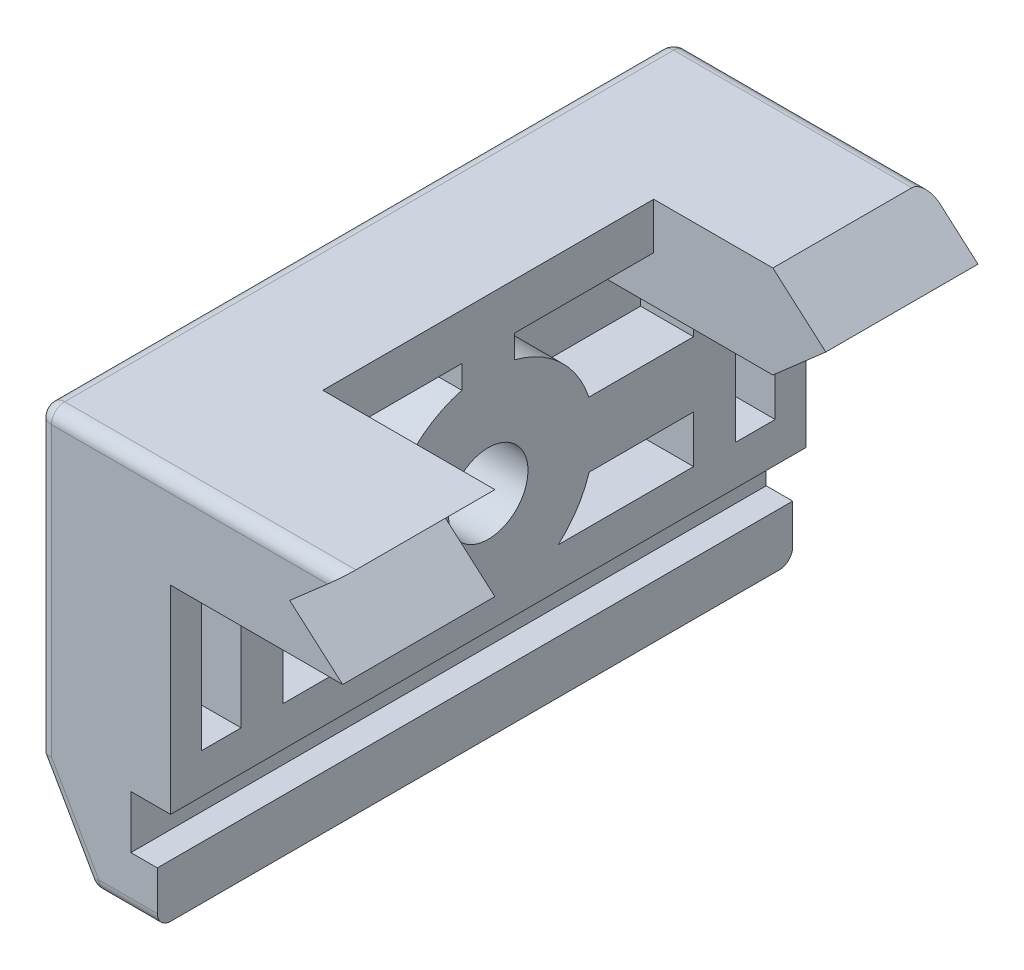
ISO-10303-21;
HEADER;
FILE_DESCRIPTION(('STEP AP214'),'2;1');
FILE_NAME('part.step','',(''),(''),'','','');
FILE_SCHEMA(('AUTOMOTIVE_DESIGN { 1 0 10303 214 1 1 1 1 }'));
ENDSEC;
DATA;
#1=APPLICATION_CONTEXT('core data for automotive mechanical design processes');
#2=APPLICATION_PROTOCOL_DEFINITION('international standard','automotive_design',2000,#1);
#3=PRODUCT_CONTEXT('',#1,'mechanical');
#4=PRODUCT('Part','Part','',(#3));
#5=PRODUCT_RELATED_PRODUCT_CATEGORY('part','',(#4));
#6=PRODUCT_DEFINITION_FORMATION('','',#4);
#7=PRODUCT_DEFINITION_CONTEXT('part definition',#1,'design');
#8=PRODUCT_DEFINITION('design','',#6,#7);
#9=PRODUCT_DEFINITION_SHAPE('','',#8);
#10=(LENGTH_UNIT() NAMED_UNIT(*) SI_UNIT(.MILLI.,.METRE.));
#11=(NAMED_UNIT(*) PLANE_ANGLE_UNIT() SI_UNIT($,.RADIAN.));
#12=(NAMED_UNIT(*) SI_UNIT($,.STERADIAN.) SOLID_ANGLE_UNIT());
#13=UNCERTAINTY_MEASURE_WITH_UNIT(LENGTH_MEASURE(1.E-05),#10,'distance_accuracy_value','');
#14=(GEOMETRIC_REPRESENTATION_CONTEXT(3) GLOBAL_UNCERTAINTY_ASSIGNED_CONTEXT((#13)) GLOBAL_UNIT_ASSIGNED_CONTEXT((#10,
#11,#12)) REPRESENTATION_CONTEXT('',''));
#15=CARTESIAN_POINT('',(0.,0.,0.));
#16=DIRECTION('',(0.,0.,1.));
#17=DIRECTION('',(1.,0.,0.));
#18=AXIS2_PLACEMENT_3D('',#15,#16,#17);
#19=CARTESIAN_POINT('',(-24.,-13.,24.));
#20=DIRECTION('',(1.,0.,0.));
#21=DIRECTION('',(0.,1.,0.));
#22=AXIS2_PLACEMENT_3D('',#19,#20,#21);
#23=CYLINDRICAL_SURFACE('',#22,3.);
#24=CARTESIAN_POINT('',(-9.00000000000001,-13.,24.));
#25=DIRECTION('',(1.,0.,0.));
#26=DIRECTION('',(0.,1.,0.));
#27=AXIS2_PLACEMENT_3D('',#24,#25,#26);
#28=CIRCLE('',#27,3.);
#29=CARTESIAN_POINT('',(-9.00000000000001,-10.,24.));
#30=VERTEX_POINT('',#29);
#31=EDGE_CURVE('E582',#30,#30,#28,.T.);
#32=ORIENTED_EDGE('',*,*,#31,.T.);
#33=EDGE_LOOP('',(#32));
#34=FACE_BOUND('',#33,.T.);
#35=CARTESIAN_POINT('',(-16.,-13.,24.));
#36=DIRECTION('',(-1.,0.,0.));
#37=DIRECTION('',(0.,-1.,0.));
#38=AXIS2_PLACEMENT_3D('',#35,#36,#37);
#39=CIRCLE('',#38,3.);
#40=CARTESIAN_POINT('',(-16.,-16.,24.));
#41=VERTEX_POINT('',#40);
#42=EDGE_CURVE('E30',#41,#41,#39,.F.);
#43=ORIENTED_EDGE('',*,*,#42,.F.);
#44=EDGE_LOOP('',(#43));
#45=FACE_BOUND('',#44,.T.);
#46=ADVANCED_FACE('F26',(#34,#45),#23,.F.);
#47=CARTESIAN_POINT('',(-13.,-15.4199876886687,39.5082742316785));
#48=DIRECTION('',(0.,-1.,0.));
#49=DIRECTION('',(0.,0.,-1.));
#50=AXIS2_PLACEMENT_3D('',#47,#48,#49);
#51=PLANE('',#50);
#52=DIRECTION('',(1.,0.,0.));
#53=VECTOR('',#52,1.);
#54=CARTESIAN_POINT('',(-13.,-15.4199876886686,31.6251989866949));
#55=LINE('',#54,#53);
#56=CARTESIAN_POINT('',(-13.,-15.4199876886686,31.6251989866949));
#57=VERTEX_POINT('',#56);
#58=CARTESIAN_POINT('',(-9.00000000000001,-15.4199876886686,31.6251989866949));
#59=VERTEX_POINT('',#58);
#60=EDGE_CURVE('E423',#57,#59,#55,.T.);
#61=ORIENTED_EDGE('',*,*,#60,.T.);
#62=DIRECTION('',(0.,0.,-1.));
#63=VECTOR('',#62,1.);
#64=CARTESIAN_POINT('',(-9.00000000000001,-15.4199876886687,39.5082742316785));
#65=LINE('',#64,#63);
#66=CARTESIAN_POINT('',(-9.00000000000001,-15.4199876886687,39.5082742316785));
#67=VERTEX_POINT('',#66);
#68=EDGE_CURVE('E50',#67,#59,#65,.T.);
#69=ORIENTED_EDGE('',*,*,#68,.F.);
#70=DIRECTION('',(1.,0.,0.));
#71=VECTOR('',#70,1.);
#72=CARTESIAN_POINT('',(-13.,-15.4199876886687,39.5082742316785));
#73=LINE('',#72,#71);
#74=CARTESIAN_POINT('',(-13.,-15.4199876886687,39.5082742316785));
#75=VERTEX_POINT('',#74);
#76=EDGE_CURVE('E417',#75,#67,#73,.T.);
#77=ORIENTED_EDGE('',*,*,#76,.F.);
#78=DIRECTION('',(0.,0.,-1.));
#79=VECTOR('',#78,1.);
#80=CARTESIAN_POINT('',(-13.,-15.4199876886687,39.5082742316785));
#81=LINE('',#80,#79);
#82=EDGE_CURVE('E405',#75,#57,#81,.T.);
#83=ORIENTED_EDGE('',*,*,#82,.T.);
#84=EDGE_LOOP('',(#61,#69,#77,#83));
#85=FACE_BOUND('',#84,.T.);
#86=ADVANCED_FACE('F912',(#85),#51,.T.);
#87=CARTESIAN_POINT('',(-13.,-13.,24.));
#88=DIRECTION('',(1.,0.,0.));
#89=DIRECTION('',(0.,1.,0.));
#90=AXIS2_PLACEMENT_3D('',#87,#88,#89);
#91=CYLINDRICAL_SURFACE('',#90,8.);
#92=DIRECTION('',(1.,0.,0.));
#93=VECTOR('',#92,1.);
#94=CARTESIAN_POINT('',(-13.,-19.,29.2915026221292));
#95=LINE('',#94,#93);
#96=CARTESIAN_POINT('',(-13.,-19.,29.2915026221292));
#97=VERTEX_POINT('',#96);
#98=CARTESIAN_POINT('',(-9.00000000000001,-19.,29.2915026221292));
#99=VERTEX_POINT('',#98);
#100=EDGE_CURVE('E421',#97,#99,#95,.T.);
#101=ORIENTED_EDGE('',*,*,#100,.T.);
#102=CARTESIAN_POINT('',(-9.00000000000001,-13.,24.));
#103=DIRECTION('',(1.,0.,0.));
#104=DIRECTION('',(0.,1.,0.));
#105=AXIS2_PLACEMENT_3D('',#102,#103,#104);
#106=CIRCLE('',#105,8.);
#107=EDGE_CURVE('E396',#59,#99,#106,.T.);
#108=ORIENTED_EDGE('',*,*,#107,.F.);
#109=ORIENTED_EDGE('',*,*,#60,.F.);
#110=CARTESIAN_POINT('',(-13.,-13.,24.));
#111=DIRECTION('',(1.,0.,0.));
#112=DIRECTION('',(0.,1.,0.));
#113=AXIS2_PLACEMENT_3D('',#110,#111,#112);
#114=CIRCLE('',#113,8.);
#115=EDGE_CURVE('E408',#57,#97,#114,.T.);
#116=ORIENTED_EDGE('',*,*,#115,.T.);
#117=EDGE_LOOP('',(#101,#108,#109,#116));
#118=FACE_BOUND('',#117,.T.);
#119=ADVANCED_FACE('F918',(#118),#91,.T.);
#120=CARTESIAN_POINT('',(-13.,-19.,39.5082742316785));
#121=DIRECTION('',(0.,-1.,0.));
#122=DIRECTION('',(1.,0.,0.));
#123=AXIS2_PLACEMENT_3D('',#120,#121,#122);
#124=PLANE('',#123);
#125=DIRECTION('',(1.,0.,0.));
#126=VECTOR('',#125,1.);
#127=CARTESIAN_POINT('',(-13.,-19.,39.5082742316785));
#128=LINE('',#127,#126);
#129=CARTESIAN_POINT('',(-13.,-19.,39.5082742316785));
#130=VERTEX_POINT('',#129);
#131=CARTESIAN_POINT('',(-9.00000000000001,-19.,39.5082742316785));
#132=VERTEX_POINT('',#131);
#133=EDGE_CURVE('E419',#130,#132,#128,.T.);
#134=ORIENTED_EDGE('',*,*,#133,.T.);
#135=DIRECTION('',(0.,0.,-1.));
#136=VECTOR('',#135,1.);
#137=CARTESIAN_POINT('',(-9.00000000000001,-19.,39.5082742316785));
#138=LINE('',#137,#136);
#139=EDGE_CURVE('E399',#132,#99,#138,.T.);
#140=ORIENTED_EDGE('',*,*,#139,.T.);
#141=ORIENTED_EDGE('',*,*,#100,.F.);
#142=DIRECTION('',(0.,0.,-1.));
#143=VECTOR('',#142,1.);
#144=CARTESIAN_POINT('',(-13.,-19.,39.5082742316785));
#145=LINE('',#144,#143);
#146=EDGE_CURVE('E411',#130,#97,#145,.T.);
#147=ORIENTED_EDGE('',*,*,#146,.F.);
#148=EDGE_LOOP('',(#134,#140,#141,#147));
#149=FACE_BOUND('',#148,.T.);
#150=ADVANCED_FACE('F1197',(#149),#124,.F.);
#151=CARTESIAN_POINT('',(-13.,-15.4199876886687,39.5082742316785));
#152=DIRECTION('',(0.,0.,1.));
#153=DIRECTION('',(0.,-1.,0.));
#154=AXIS2_PLACEMENT_3D('',#151,#152,#153);
#155=PLANE('',#154);
#156=DIRECTION('',(0.,-1.,0.));
#157=VECTOR('',#156,1.);
#158=CARTESIAN_POINT('',(-13.,-15.4199876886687,39.5082742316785));
#159=LINE('',#158,#157);
#160=EDGE_CURVE('E414',#75,#130,#159,.T.);
#161=ORIENTED_EDGE('',*,*,#160,.F.);
#162=ORIENTED_EDGE('',*,*,#76,.T.);
#163=DIRECTION('',(0.,-1.,0.));
#164=VECTOR('',#163,1.);
#165=CARTESIAN_POINT('',(-9.00000000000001,-15.4199876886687,39.5082742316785));
#166=LINE('',#165,#164);
#167=EDGE_CURVE('E402',#67,#132,#166,.T.);
#168=ORIENTED_EDGE('',*,*,#167,.T.);
#169=ORIENTED_EDGE('',*,*,#133,.F.);
#170=EDGE_LOOP('',(#161,#162,#168,#169));
#171=FACE_BOUND('',#170,.T.);
#172=ADVANCED_FACE('F1195',(#171),#155,.F.);
#173=CARTESIAN_POINT('',(-13.,-13.,24.));
#174=DIRECTION('',(1.,0.,0.));
#175=DIRECTION('',(0.,1.,0.));
#176=AXIS2_PLACEMENT_3D('',#173,#174,#175);
#177=PLANE('',#176);
#178=ORIENTED_EDGE('',*,*,#82,.F.);
#179=ORIENTED_EDGE('',*,*,#160,.T.);
#180=ORIENTED_EDGE('',*,*,#146,.T.);
#181=ORIENTED_EDGE('',*,*,#115,.F.);
#182=EDGE_LOOP('',(#178,#179,#180,#181));
#183=FACE_BOUND('',#182,.T.);
#184=ADVANCED_FACE('F1193',(#183),#177,.T.);
#185=CARTESIAN_POINT('',(-9.00000000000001,-6.99999999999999,48.));
#186=DIRECTION('',(1.,0.,0.));
#187=DIRECTION('',(0.,1.,0.));
#188=AXIS2_PLACEMENT_3D('',#185,#186,#187);
#189=PLANE('',#188);
#190=DIRECTION('',(0.,0.,1.));
#191=VECTOR('',#190,1.);
#192=CARTESIAN_POINT('',(-9.00000000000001,-15.4199876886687,8.4917257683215));
#193=LINE('',#192,#191);
#194=CARTESIAN_POINT('',(-9.00000000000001,-15.4199876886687,8.4917257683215));
#195=VERTEX_POINT('',#194);
#196=CARTESIAN_POINT('',(-9.00000000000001,-15.4199876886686,16.3748010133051));
#197=VERTEX_POINT('',#196);
#198=EDGE_CURVE('E42',#195,#197,#193,.T.);
#199=ORIENTED_EDGE('',*,*,#198,.F.);
#200=DIRECTION('',(0.,-1.,0.));
#201=VECTOR('',#200,1.);
#202=CARTESIAN_POINT('',(-9.00000000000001,-15.4199876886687,8.4917257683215));
#203=LINE('',#202,#201);
#204=CARTESIAN_POINT('',(-9.00000000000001,-19.,8.49172576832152));
#205=VERTEX_POINT('',#204);
#206=EDGE_CURVE('E377',#195,#205,#203,.T.);
#207=ORIENTED_EDGE('',*,*,#206,.T.);
#208=DIRECTION('',(0.,0.,1.));
#209=VECTOR('',#208,1.);
#210=CARTESIAN_POINT('',(-9.00000000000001,-19.,8.49172576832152));
#211=LINE('',#210,#209);
#212=CARTESIAN_POINT('',(-9.00000000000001,-19.,18.7084973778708));
#213=VERTEX_POINT('',#212);
#214=EDGE_CURVE('E359',#205,#213,#211,.T.);
#215=ORIENTED_EDGE('',*,*,#214,.T.);
#216=CARTESIAN_POINT('',(-9.00000000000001,-13.,24.));
#217=DIRECTION('',(1.,0.,0.));
#218=DIRECTION('',(0.,1.,0.));
#219=AXIS2_PLACEMENT_3D('',#216,#217,#218);
#220=CIRCLE('',#219,8.);
#221=EDGE_CURVE('E370',#213,#197,#220,.T.);
#222=ORIENTED_EDGE('',*,*,#221,.T.);
#223=EDGE_LOOP('',(#199,#207,#215,#222));
#224=FACE_BOUND('',#223,.T.);
#225=ORIENTED_EDGE('',*,*,#31,.F.);
#226=EDGE_LOOP('',(#225));
#227=FACE_BOUND('',#226,.T.);
#228=DIRECTION('',(0.,0.,1.));
#229=VECTOR('',#228,1.);
#230=CARTESIAN_POINT('',(-9.00000000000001,-3.5,11.5));
#231=LINE('',#230,#229);
#232=CARTESIAN_POINT('',(-9.00000000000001,-3.5,11.5));
#233=VERTEX_POINT('',#232);
#234=CARTESIAN_POINT('',(-9.00000000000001,-3.49999999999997,22.0009614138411));
#235=VERTEX_POINT('',#234);
#236=EDGE_CURVE('E431',#233,#235,#231,.T.);
#237=ORIENTED_EDGE('',*,*,#236,.F.);
#238=DIRECTION('',(0.,-1.,0.));
#239=VECTOR('',#238,1.);
#240=CARTESIAN_POINT('',(-9.,41.,11.5));
#241=LINE('',#240,#239);
#242=CARTESIAN_POINT('',(-9.00000000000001,0.,11.5));
#243=VERTEX_POINT('',#242);
#244=EDGE_CURVE('E639',#243,#233,#241,.T.);
#245=ORIENTED_EDGE('',*,*,#244,.F.);
#246=DIRECTION('',(0.,0.,-1.));
#247=VECTOR('',#246,1.);
#248=CARTESIAN_POINT('',(-9.00000000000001,0.,48.));
#249=LINE('',#248,#247);
#250=CARTESIAN_POINT('',(-9.00000000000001,0.,36.5));
#251=VERTEX_POINT('',#250);
#252=EDGE_CURVE('E704',#251,#243,#249,.T.);
#253=ORIENTED_EDGE('',*,*,#252,.F.);
#254=DIRECTION('',(0.,-1.,0.));
#255=VECTOR('',#254,1.);
#256=CARTESIAN_POINT('',(-9.,41.,36.5));
#257=LINE('',#256,#255);
#258=CARTESIAN_POINT('',(-9.00000000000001,-3.5,36.5));
#259=VERTEX_POINT('',#258);
#260=EDGE_CURVE('E636',#251,#259,#257,.T.);
#261=ORIENTED_EDGE('',*,*,#260,.T.);
#262=DIRECTION('',(0.,0.,-1.));
#263=VECTOR('',#262,1.);
#264=CARTESIAN_POINT('',(-9.00000000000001,-3.5,36.5));
#265=LINE('',#264,#263);
#266=CARTESIAN_POINT('',(-9.00000000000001,-3.49999999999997,25.9990385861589));
#267=VERTEX_POINT('',#266);
#268=EDGE_CURVE('E516',#259,#267,#265,.T.);
#269=ORIENTED_EDGE('',*,*,#268,.T.);
#270=DIRECTION('',(0.,1.,0.));
#271=VECTOR('',#270,1.);
#272=CARTESIAN_POINT('',(-9.00000000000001,-5.25378513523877,25.9990385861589));
#273=LINE('',#272,#271);
#274=CARTESIAN_POINT('',(-9.00000000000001,-5.25378513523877,25.9990385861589));
#275=VERTEX_POINT('',#274);
#276=EDGE_CURVE('E513',#275,#267,#273,.T.);
#277=ORIENTED_EDGE('',*,*,#276,.F.);
#278=CARTESIAN_POINT('',(-9.00000000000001,-13.,24.));
#279=DIRECTION('',(1.,0.,0.));
#280=DIRECTION('',(0.,1.,0.));
#281=AXIS2_PLACEMENT_3D('',#278,#279,#280);
#282=CIRCLE('',#281,8.);
#283=CARTESIAN_POINT('',(-9.00000000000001,-10.5,31.5993420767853));
#284=VERTEX_POINT('',#283);
#285=EDGE_CURVE('E510',#275,#284,#282,.T.);
#286=ORIENTED_EDGE('',*,*,#285,.T.);
#287=DIRECTION('',(0.,0.,-1.));
#288=VECTOR('',#287,1.);
#289=CARTESIAN_POINT('',(-9.00000000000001,-10.5,39.5082742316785));
#290=LINE('',#289,#288);
#291=CARTESIAN_POINT('',(-9.00000000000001,-10.5,39.5082742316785));
#292=VERTEX_POINT('',#291);
#293=EDGE_CURVE('E507',#292,#284,#290,.T.);
#294=ORIENTED_EDGE('',*,*,#293,.F.);
#295=DIRECTION('',(0.,-1.,0.));
#296=VECTOR('',#295,1.);
#297=CARTESIAN_POINT('',(-9.00000000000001,-7.,39.5082742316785));
#298=LINE('',#297,#296);
#299=CARTESIAN_POINT('',(-9.00000000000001,-7.,39.5082742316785));
#300=VERTEX_POINT('',#299);
#301=EDGE_CURVE('E504',#300,#292,#298,.T.);
#302=ORIENTED_EDGE('',*,*,#301,.F.);
#303=DIRECTION('',(0.,0.,-1.));
#304=VECTOR('',#303,1.);
#305=CARTESIAN_POINT('',(-9.00000000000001,-6.99999999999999,48.));
#306=LINE('',#305,#304);
#307=CARTESIAN_POINT('',(-9.00000000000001,-6.99999999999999,42.6765287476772));
#308=VERTEX_POINT('',#307);
#309=EDGE_CURVE('E687',#308,#300,#306,.T.);
#310=ORIENTED_EDGE('',*,*,#309,.F.);
#311=DIRECTION('',(0.,-1.,0.));
#312=VECTOR('',#311,1.);
#313=CARTESIAN_POINT('',(-9.00000000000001,-6.99999999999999,42.6765287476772));
#314=LINE('',#313,#312);
#315=CARTESIAN_POINT('',(-9.00000000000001,-19.,42.6765287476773));
#316=VERTEX_POINT('',#315);
#317=EDGE_CURVE('E558',#308,#316,#314,.T.);
#318=ORIENTED_EDGE('',*,*,#317,.T.);
#319=DIRECTION('',(0.,0.,1.));
#320=VECTOR('',#319,1.);
#321=CARTESIAN_POINT('',(-9.00000000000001,-19.,42.6765287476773));
#322=LINE('',#321,#320);
#323=CARTESIAN_POINT('',(-9.00000000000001,-19.,45.6765287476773));
#324=VERTEX_POINT('',#323);
#325=EDGE_CURVE('E555',#316,#324,#322,.T.);
#326=ORIENTED_EDGE('',*,*,#325,.T.);
#327=DIRECTION('',(0.,-1.,0.));
#328=VECTOR('',#327,1.);
#329=CARTESIAN_POINT('',(-9.00000000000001,-7.,45.6765287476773));
#330=LINE('',#329,#328);
#331=CARTESIAN_POINT('',(-9.00000000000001,-7.,45.6765287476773));
#332=VERTEX_POINT('',#331);
#333=EDGE_CURVE('E552',#332,#324,#330,.T.);
#334=ORIENTED_EDGE('',*,*,#333,.F.);
#335=CARTESIAN_POINT('',(-9.00000000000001,-6.99999999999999,48.));
#336=VERTEX_POINT('',#335);
#337=EDGE_CURVE('E683',#336,#332,#306,.T.);
#338=ORIENTED_EDGE('',*,*,#337,.F.);
#339=DIRECTION('',(0.,-1.,0.));
#340=VECTOR('',#339,1.);
#341=CARTESIAN_POINT('',(-9.00000000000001,-6.99999999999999,48.));
#342=LINE('',#341,#340);
#343=CARTESIAN_POINT('',(-9.00000000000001,-22.,48.));
#344=VERTEX_POINT('',#343);
#345=EDGE_CURVE('E663',#336,#344,#342,.T.);
#346=ORIENTED_EDGE('',*,*,#345,.T.);
#347=DIRECTION('',(0.,0.,-1.));
#348=VECTOR('',#347,1.);
#349=CARTESIAN_POINT('',(-9.00000000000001,-22.,48.));
#350=LINE('',#349,#348);
#351=CARTESIAN_POINT('',(-9.00000000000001,-22.,0.));
#352=VERTEX_POINT('',#351);
#353=EDGE_CURVE('E686',#344,#352,#350,.T.);
#354=ORIENTED_EDGE('',*,*,#353,.T.);
#355=DIRECTION('',(0.,-1.,0.));
#356=VECTOR('',#355,1.);
#357=CARTESIAN_POINT('',(-9.00000000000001,-6.99999999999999,0.));
#358=LINE('',#357,#356);
#359=CARTESIAN_POINT('',(-9.00000000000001,-6.99999999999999,0.));
#360=VERTEX_POINT('',#359);
#361=EDGE_CURVE('E645',#360,#352,#358,.T.);
#362=ORIENTED_EDGE('',*,*,#361,.F.);
#363=CARTESIAN_POINT('',(-9.00000000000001,-6.99999999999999,2.32347125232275));
#364=VERTEX_POINT('',#363);
#365=EDGE_CURVE('E682',#364,#360,#306,.T.);
#366=ORIENTED_EDGE('',*,*,#365,.F.);
#367=DIRECTION('',(0.,-1.,0.));
#368=VECTOR('',#367,1.);
#369=CARTESIAN_POINT('',(-9.00000000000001,-7.,2.32347125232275));
#370=LINE('',#369,#368);
#371=CARTESIAN_POINT('',(-9.00000000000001,-19.,2.32347125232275));
#372=VERTEX_POINT('',#371);
#373=EDGE_CURVE('E473',#364,#372,#370,.T.);
#374=ORIENTED_EDGE('',*,*,#373,.T.);
#375=DIRECTION('',(0.,0.,-1.));
#376=VECTOR('',#375,1.);
#377=CARTESIAN_POINT('',(-9.00000000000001,-19.,5.32347125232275));
#378=LINE('',#377,#376);
#379=CARTESIAN_POINT('',(-9.00000000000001,-19.,5.32347125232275));
#380=VERTEX_POINT('',#379);
#381=EDGE_CURVE('E476',#380,#372,#378,.T.);
#382=ORIENTED_EDGE('',*,*,#381,.F.);
#383=DIRECTION('',(0.,-1.,0.));
#384=VECTOR('',#383,1.);
#385=CARTESIAN_POINT('',(-9.00000000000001,-6.99999999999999,5.32347125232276));
#386=LINE('',#385,#384);
#387=CARTESIAN_POINT('',(-9.00000000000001,-6.99999999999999,5.32347125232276));
#388=VERTEX_POINT('',#387);
#389=EDGE_CURVE('E479',#388,#380,#386,.T.);
#390=ORIENTED_EDGE('',*,*,#389,.F.);
#391=CARTESIAN_POINT('',(-9.00000000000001,-7.,8.49172576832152));
#392=VERTEX_POINT('',#391);
#393=EDGE_CURVE('E688',#392,#388,#306,.T.);
#394=ORIENTED_EDGE('',*,*,#393,.F.);
#395=DIRECTION('',(0.,-1.,0.));
#396=VECTOR('',#395,1.);
#397=CARTESIAN_POINT('',(-9.00000000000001,-7.,8.49172576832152));
#398=LINE('',#397,#396);
#399=CARTESIAN_POINT('',(-9.00000000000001,-10.5,8.4917257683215));
#400=VERTEX_POINT('',#399);
#401=EDGE_CURVE('E434',#392,#400,#398,.T.);
#402=ORIENTED_EDGE('',*,*,#401,.T.);
#403=DIRECTION('',(0.,0.,1.));
#404=VECTOR('',#403,1.);
#405=CARTESIAN_POINT('',(-9.00000000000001,-10.5,8.4917257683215));
#406=LINE('',#405,#404);
#407=CARTESIAN_POINT('',(-9.00000000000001,-10.5,16.4006579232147));
#408=VERTEX_POINT('',#407);
#409=EDGE_CURVE('E437',#400,#408,#406,.T.);
#410=ORIENTED_EDGE('',*,*,#409,.T.);
#411=CARTESIAN_POINT('',(-9.00000000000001,-13.,24.));
#412=DIRECTION('',(1.,0.,0.));
#413=DIRECTION('',(0.,1.,0.));
#414=AXIS2_PLACEMENT_3D('',#411,#412,#413);
#415=CIRCLE('',#414,8.);
#416=CARTESIAN_POINT('',(-9.00000000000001,-5.25378513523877,22.0009614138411));
#417=VERTEX_POINT('',#416);
#418=EDGE_CURVE('E425',#408,#417,#415,.T.);
#419=ORIENTED_EDGE('',*,*,#418,.T.);
#420=DIRECTION('',(0.,1.,0.));
#421=VECTOR('',#420,1.);
#422=CARTESIAN_POINT('',(-9.00000000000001,-5.25378513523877,22.0009614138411));
#423=LINE('',#422,#421);
#424=EDGE_CURVE('E428',#417,#235,#423,.T.);
#425=ORIENTED_EDGE('',*,*,#424,.T.);
#426=EDGE_LOOP('',(#237,#245,#253,#261,#269,#277,#286,#294,#302,#310,#318,#326,#334,#338,#346,
#354,#362,#366,#374,#382,#390,#394,#402,#410,#419,#425));
#427=FACE_BOUND('',#426,.T.);
#428=ORIENTED_EDGE('',*,*,#167,.F.);
#429=ORIENTED_EDGE('',*,*,#68,.T.);
#430=ORIENTED_EDGE('',*,*,#107,.T.);
#431=ORIENTED_EDGE('',*,*,#139,.F.);
#432=EDGE_LOOP('',(#428,#429,#430,#431));
#433=FACE_BOUND('',#432,.T.);
#434=ADVANCED_FACE('F374',(#224,#227,#427,#433),#189,.T.);
#435=CARTESIAN_POINT('',(3.99999999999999,-7.,48.));
#436=DIRECTION('',(0.,-1.,0.));
#437=DIRECTION('',(1.,0.,0.));
#438=AXIS2_PLACEMENT_3D('',#435,#436,#437);
#439=PLANE('',#438);
#440=DIRECTION('',(-1.,0.,0.));
#441=VECTOR('',#440,1.);
#442=CARTESIAN_POINT('',(3.99999999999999,-7.,0.));
#443=LINE('',#442,#441);
#444=CARTESIAN_POINT('',(0.,-7.,0.));
#445=VERTEX_POINT('',#444);
#446=EDGE_CURVE('E642',#445,#360,#443,.T.);
#447=ORIENTED_EDGE('',*,*,#446,.F.);
#448=DIRECTION('',(0.,0.,-1.));
#449=VECTOR('',#448,1.);
#450=CARTESIAN_POINT('',(0.,-7.,15.));
#451=LINE('',#450,#449);
#452=CARTESIAN_POINT('',(0.,-7.,11.5));
#453=VERTEX_POINT('',#452);
#454=EDGE_CURVE('E610',#453,#445,#451,.T.);
#455=ORIENTED_EDGE('',*,*,#454,.F.);
#456=DIRECTION('',(1.,0.,0.));
#457=VECTOR('',#456,1.);
#458=CARTESIAN_POINT('',(-9.00000000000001,-6.99999999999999,11.5));
#459=LINE('',#458,#457);
#460=CARTESIAN_POINT('',(-13.,-6.99999999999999,11.5));
#461=VERTEX_POINT('',#460);
#462=EDGE_CURVE('E631',#461,#453,#459,.T.);
#463=ORIENTED_EDGE('',*,*,#462,.F.);
#464=DIRECTION('',(0.,0.,-1.));
#465=VECTOR('',#464,1.);
#466=CARTESIAN_POINT('',(-13.,-6.99999999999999,11.5));
#467=LINE('',#466,#465);
#468=CARTESIAN_POINT('',(-13.,-6.99999999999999,8.49172576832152));
#469=VERTEX_POINT('',#468);
#470=EDGE_CURVE('E452',#461,#469,#467,.T.);
#471=ORIENTED_EDGE('',*,*,#470,.T.);
#472=DIRECTION('',(1.,0.,0.));
#473=VECTOR('',#472,1.);
#474=CARTESIAN_POINT('',(-13.,-6.99999999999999,8.49172576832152));
#475=LINE('',#474,#473);
#476=EDGE_CURVE('E465',#469,#392,#475,.T.);
#477=ORIENTED_EDGE('',*,*,#476,.T.);
#478=ORIENTED_EDGE('',*,*,#393,.T.);
#479=DIRECTION('',(1.,0.,0.));
#480=VECTOR('',#479,1.);
#481=CARTESIAN_POINT('',(-13.,-6.99999999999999,5.32347125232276));
#482=LINE('',#481,#480);
#483=CARTESIAN_POINT('',(-13.,-6.99999999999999,5.32347125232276));
#484=VERTEX_POINT('',#483);
#485=EDGE_CURVE('E497',#484,#388,#482,.T.);
#486=ORIENTED_EDGE('',*,*,#485,.F.);
#487=DIRECTION('',(0.,0.,1.));
#488=VECTOR('',#487,1.);
#489=CARTESIAN_POINT('',(-13.,-6.99999999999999,2.32347125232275));
#490=LINE('',#489,#488);
#491=CARTESIAN_POINT('',(-13.,-6.99999999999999,2.32347125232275));
#492=VERTEX_POINT('',#491);
#493=EDGE_CURVE('E491',#492,#484,#490,.T.);
#494=ORIENTED_EDGE('',*,*,#493,.F.);
#495=DIRECTION('',(1.,0.,0.));
#496=VECTOR('',#495,1.);
#497=CARTESIAN_POINT('',(-13.,-6.99999999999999,2.32347125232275));
#498=LINE('',#497,#496);
#499=EDGE_CURVE('E494',#492,#364,#498,.T.);
#500=ORIENTED_EDGE('',*,*,#499,.T.);
#501=ORIENTED_EDGE('',*,*,#365,.T.);
#502=EDGE_LOOP('',(#447,#455,#463,#471,#477,#478,#486,#494,#500,#501));
#503=FACE_BOUND('',#502,.T.);
#504=ADVANCED_FACE('F860',(#503),#439,.T.);
#505=CARTESIAN_POINT('',(-12.,0.,0.));
#506=DIRECTION('',(0.,0.,-1.));
#507=DIRECTION('',(-1.,0.,0.));
#508=AXIS2_PLACEMENT_3D('',#505,#506,#507);
#509=PLANE('',#508);
#510=DIRECTION('',(0.,-1.,0.));
#511=VECTOR('',#510,1.);
#512=CARTESIAN_POINT('',(-10.,-26.,0.));
#513=LINE('',#512,#511);
#514=CARTESIAN_POINT('',(-10.,-26.,0.));
#515=VERTEX_POINT('',#514);
#516=CARTESIAN_POINT('',(-10.,-29.,0.));
#517=VERTEX_POINT('',#516);
#518=EDGE_CURVE('E657',#515,#517,#513,.T.);
#519=ORIENTED_EDGE('',*,*,#518,.T.);
#520=DIRECTION('',(-1.,0.,0.));
#521=VECTOR('',#520,1.);
#522=CARTESIAN_POINT('',(-12.,-29.,0.));
#523=LINE('',#522,#521);
#524=CARTESIAN_POINT('',(-14.4196774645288,-29.,0.));
#525=VERTEX_POINT('',#524);
#526=EDGE_CURVE('E746',#517,#525,#523,.T.);
#527=ORIENTED_EDGE('',*,*,#526,.T.);
#528=DIRECTION('',(0.496138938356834,-0.868243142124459,0.));
#529=VECTOR('',#528,1.);
#530=CARTESIAN_POINT('',(-18.1317568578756,-22.5038610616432,0.));
#531=LINE('',#530,#529);
#532=CARTESIAN_POINT('',(-18.,-22.7344355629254,0.));
#533=VERTEX_POINT('',#532);
#534=EDGE_CURVE('E718',#525,#533,#531,.F.);
#535=ORIENTED_EDGE('',*,*,#534,.T.);
#536=DIRECTION('',(0.,-1.,0.));
#537=VECTOR('',#536,1.);
#538=CARTESIAN_POINT('',(-18.,0.,0.));
#539=LINE('',#538,#537);
#540=CARTESIAN_POINT('',(-18.,-1.,0.));
#541=VERTEX_POINT('',#540);
#542=EDGE_CURVE('E720',#533,#541,#539,.F.);
#543=ORIENTED_EDGE('',*,*,#542,.T.);
#544=DIRECTION('',(1.,0.,0.));
#545=VECTOR('',#544,1.);
#546=CARTESIAN_POINT('',(-12.,-1.,0.));
#547=LINE('',#546,#545);
#548=CARTESIAN_POINT('',(1.14285714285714,-1.,0.));
#549=VERTEX_POINT('',#548);
#550=EDGE_CURVE('E723',#541,#549,#547,.T.);
#551=ORIENTED_EDGE('',*,*,#550,.T.);
#552=DIRECTION('',(-0.752576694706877,0.658504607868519,0.));
#553=VECTOR('',#552,1.);
#554=CARTESIAN_POINT('',(3.99999999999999,-3.5,0.));
#555=LINE('',#554,#553);
#556=CARTESIAN_POINT('',(3.99999999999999,-3.5,0.));
#557=VERTEX_POINT('',#556);
#558=EDGE_CURVE('E614',#557,#549,#555,.T.);
#559=ORIENTED_EDGE('',*,*,#558,.F.);
#560=DIRECTION('',(-0.752576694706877,-0.658504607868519,0.));
#561=VECTOR('',#560,1.);
#562=CARTESIAN_POINT('',(3.99999999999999,-3.5,0.));
#563=LINE('',#562,#561);
#564=EDGE_CURVE('E607',#557,#445,#563,.T.);
#565=ORIENTED_EDGE('',*,*,#564,.T.);
#566=ORIENTED_EDGE('',*,*,#446,.T.);
#567=ORIENTED_EDGE('',*,*,#361,.T.);
#568=DIRECTION('',(-1.,0.,0.));
#569=VECTOR('',#568,1.);
#570=CARTESIAN_POINT('',(-9.00000000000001,-22.,0.));
#571=LINE('',#570,#569);
#572=CARTESIAN_POINT('',(-12.,-22.,0.));
#573=VERTEX_POINT('',#572);
#574=EDGE_CURVE('E648',#352,#573,#571,.T.);
#575=ORIENTED_EDGE('',*,*,#574,.T.);
#576=DIRECTION('',(0.,-1.,0.));
#577=VECTOR('',#576,1.);
#578=CARTESIAN_POINT('',(-12.,-22.,0.));
#579=LINE('',#578,#577);
#580=CARTESIAN_POINT('',(-12.,-26.,0.));
#581=VERTEX_POINT('',#580);
#582=EDGE_CURVE('E651',#573,#581,#579,.T.);
#583=ORIENTED_EDGE('',*,*,#582,.T.);
#584=DIRECTION('',(1.,0.,0.));
#585=VECTOR('',#584,1.);
#586=CARTESIAN_POINT('',(-12.,-26.,0.));
#587=LINE('',#586,#585);
#588=EDGE_CURVE('E654',#581,#515,#587,.T.);
#589=ORIENTED_EDGE('',*,*,#588,.T.);
#590=EDGE_LOOP('',(#519,#527,#535,#543,#551,#559,#565,#566,#567,#575,#583,#589));
#591=FACE_BOUND('',#590,.T.);
#592=ADVANCED_FACE('F851',(#591),#509,.T.);
#593=CARTESIAN_POINT('',(-9.,41.,11.5));
#594=DIRECTION('',(0.,0.,-1.));
#595=DIRECTION('',(-1.,0.,0.));
#596=AXIS2_PLACEMENT_3D('',#593,#594,#595);
#597=PLANE('',#596);
#598=DIRECTION('',(-0.752576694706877,-0.658504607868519,0.));
#599=VECTOR('',#598,1.);
#600=CARTESIAN_POINT('',(18.6902654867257,9.35398230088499,11.5));
#601=LINE('',#600,#599);
#602=CARTESIAN_POINT('',(3.99999999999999,-3.5,11.5));
#603=VERTEX_POINT('',#602);
#604=EDGE_CURVE('E612',#603,#453,#601,.T.);
#605=ORIENTED_EDGE('',*,*,#604,.F.);
#606=DIRECTION('',(-0.752576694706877,0.658504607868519,0.));
#607=VECTOR('',#606,1.);
#608=CARTESIAN_POINT('',(-25.4159292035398,22.2389380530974,11.5));
#609=LINE('',#608,#607);
#610=CARTESIAN_POINT('',(0.,0.,11.5));
#611=VERTEX_POINT('',#610);
#612=EDGE_CURVE('E715',#603,#611,#609,.T.);
#613=ORIENTED_EDGE('',*,*,#612,.T.);
#614=DIRECTION('',(-1.,0.,0.));
#615=VECTOR('',#614,1.);
#616=CARTESIAN_POINT('',(0.,0.,11.5));
#617=LINE('',#616,#615);
#618=EDGE_CURVE('E707',#611,#243,#617,.T.);
#619=ORIENTED_EDGE('',*,*,#618,.T.);
#620=ORIENTED_EDGE('',*,*,#244,.T.);
#621=DIRECTION('',(1.,0.,0.));
#622=VECTOR('',#621,1.);
#623=CARTESIAN_POINT('',(-13.,-3.5,11.5));
#624=LINE('',#623,#622);
#625=CARTESIAN_POINT('',(-13.,-3.5,11.5));
#626=VERTEX_POINT('',#625);
#627=EDGE_CURVE('E467',#626,#233,#624,.T.);
#628=ORIENTED_EDGE('',*,*,#627,.F.);
#629=DIRECTION('',(0.,-1.,0.));
#630=VECTOR('',#629,1.);
#631=CARTESIAN_POINT('',(-13.,-3.5,11.5));
#632=LINE('',#631,#630);
#633=EDGE_CURVE('E449',#626,#461,#632,.T.);
#634=ORIENTED_EDGE('',*,*,#633,.T.);
#635=ORIENTED_EDGE('',*,*,#462,.T.);
#636=EDGE_LOOP('',(#605,#613,#619,#620,#628,#634,#635));
#637=FACE_BOUND('',#636,.T.);
#638=ADVANCED_FACE('F842',(#637),#597,.F.);
#639=CARTESIAN_POINT('',(-12.,0.,48.));
#640=DIRECTION('',(0.,0.,-1.));
#641=DIRECTION('',(-1.,0.,0.));
#642=AXIS2_PLACEMENT_3D('',#639,#640,#641);
#643=PLANE('',#642);
#644=DIRECTION('',(0.752576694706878,0.658504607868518,0.));
#645=VECTOR('',#644,1.);
#646=CARTESIAN_POINT('',(0.,-3.5,48.));
#647=LINE('',#646,#645);
#648=CARTESIAN_POINT('',(0.,-3.5,48.));
#649=VERTEX_POINT('',#648);
#650=CARTESIAN_POINT('',(2.85714285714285,-1.,48.));
#651=VERTEX_POINT('',#650);
#652=EDGE_CURVE('E626',#649,#651,#647,.T.);
#653=ORIENTED_EDGE('',*,*,#652,.T.);
#654=DIRECTION('',(1.,0.,0.));
#655=VECTOR('',#654,1.);
#656=CARTESIAN_POINT('',(0.,-1.,48.));
#657=LINE('',#656,#655);
#658=CARTESIAN_POINT('',(-18.,-1.,48.));
#659=VERTEX_POINT('',#658);
#660=EDGE_CURVE('E763',#651,#659,#657,.F.);
#661=ORIENTED_EDGE('',*,*,#660,.T.);
#662=DIRECTION('',(0.,-1.,0.));
#663=VECTOR('',#662,1.);
#664=CARTESIAN_POINT('',(-18.,0.,48.));
#665=LINE('',#664,#663);
#666=CARTESIAN_POINT('',(-18.,-22.7344355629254,48.));
#667=VERTEX_POINT('',#666);
#668=EDGE_CURVE('E761',#659,#667,#665,.T.);
#669=ORIENTED_EDGE('',*,*,#668,.T.);
#670=DIRECTION('',(0.496138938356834,-0.868243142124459,0.));
#671=VECTOR('',#670,1.);
#672=CARTESIAN_POINT('',(-26.3163722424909,-8.18078413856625,48.));
#673=LINE('',#672,#671);
#674=CARTESIAN_POINT('',(-14.4196774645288,-29.,48.));
#675=VERTEX_POINT('',#674);
#676=EDGE_CURVE('E759',#667,#675,#673,.T.);
#677=ORIENTED_EDGE('',*,*,#676,.T.);
#678=DIRECTION('',(-1.,0.,0.));
#679=VECTOR('',#678,1.);
#680=CARTESIAN_POINT('',(-10.,-29.,48.));
#681=LINE('',#680,#679);
#682=CARTESIAN_POINT('',(-10.,-29.,48.));
#683=VERTEX_POINT('',#682);
#684=EDGE_CURVE('E757',#675,#683,#681,.F.);
#685=ORIENTED_EDGE('',*,*,#684,.T.);
#686=DIRECTION('',(0.,-1.,0.));
#687=VECTOR('',#686,1.);
#688=CARTESIAN_POINT('',(-10.,-26.,48.));
#689=LINE('',#688,#687);
#690=CARTESIAN_POINT('',(-10.,-26.,48.));
#691=VERTEX_POINT('',#690);
#692=EDGE_CURVE('E675',#691,#683,#689,.T.);
#693=ORIENTED_EDGE('',*,*,#692,.F.);
#694=DIRECTION('',(1.,0.,0.));
#695=VECTOR('',#694,1.);
#696=CARTESIAN_POINT('',(-12.,-26.,48.));
#697=LINE('',#696,#695);
#698=CARTESIAN_POINT('',(-12.,-26.,48.));
#699=VERTEX_POINT('',#698);
#700=EDGE_CURVE('E672',#699,#691,#697,.T.);
#701=ORIENTED_EDGE('',*,*,#700,.F.);
#702=DIRECTION('',(0.,-1.,0.));
#703=VECTOR('',#702,1.);
#704=CARTESIAN_POINT('',(-12.,-22.,48.));
#705=LINE('',#704,#703);
#706=CARTESIAN_POINT('',(-12.,-22.,48.));
#707=VERTEX_POINT('',#706);
#708=EDGE_CURVE('E669',#707,#699,#705,.T.);
#709=ORIENTED_EDGE('',*,*,#708,.F.);
#710=DIRECTION('',(-1.,0.,0.));
#711=VECTOR('',#710,1.);
#712=CARTESIAN_POINT('',(-9.00000000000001,-22.,48.));
#713=LINE('',#712,#711);
#714=EDGE_CURVE('E666',#344,#707,#713,.T.);
#715=ORIENTED_EDGE('',*,*,#714,.F.);
#716=ORIENTED_EDGE('',*,*,#345,.F.);
#717=DIRECTION('',(-1.,0.,0.));
#718=VECTOR('',#717,1.);
#719=CARTESIAN_POINT('',(3.99999999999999,-7.,48.));
#720=LINE('',#719,#718);
#721=CARTESIAN_POINT('',(3.99999999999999,-7.,48.));
#722=VERTEX_POINT('',#721);
#723=EDGE_CURVE('E660',#722,#336,#720,.T.);
#724=ORIENTED_EDGE('',*,*,#723,.F.);
#725=DIRECTION('',(-0.752576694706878,0.658504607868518,0.));
#726=VECTOR('',#725,1.);
#727=CARTESIAN_POINT('',(3.99999999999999,-7.,48.));
#728=LINE('',#727,#726);
#729=EDGE_CURVE('E623',#722,#649,#728,.T.);
#730=ORIENTED_EDGE('',*,*,#729,.T.);
#731=EDGE_LOOP('',(#653,#661,#669,#677,#685,#693,#701,#709,#715,#716,#724,#730));
#732=FACE_BOUND('',#731,.T.);
#733=ADVANCED_FACE('F821',(#732),#643,.F.);
#734=CARTESIAN_POINT('',(4.,41.,36.5));
#735=DIRECTION('',(0.,0.,1.));
#736=DIRECTION('',(1.,0.,0.));
#737=AXIS2_PLACEMENT_3D('',#734,#735,#736);
#738=PLANE('',#737);
#739=DIRECTION('',(-0.752576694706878,0.658504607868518,0.));
#740=VECTOR('',#739,1.);
#741=CARTESIAN_POINT('',(-19.787610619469,13.8141592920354,36.5));
#742=LINE('',#741,#740);
#743=CARTESIAN_POINT('',(3.99999999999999,-7.,36.5));
#744=VERTEX_POINT('',#743);
#745=CARTESIAN_POINT('',(0.,-3.5,36.5));
#746=VERTEX_POINT('',#745);
#747=EDGE_CURVE('E712',#744,#746,#742,.T.);
#748=ORIENTED_EDGE('',*,*,#747,.F.);
#749=DIRECTION('',(-1.,0.,0.));
#750=VECTOR('',#749,1.);
#751=CARTESIAN_POINT('',(3.99999999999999,-7.,36.5));
#752=LINE('',#751,#750);
#753=CARTESIAN_POINT('',(-13.,-6.99999999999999,36.5));
#754=VERTEX_POINT('',#753);
#755=EDGE_CURVE('E634',#744,#754,#752,.T.);
#756=ORIENTED_EDGE('',*,*,#755,.T.);
#757=DIRECTION('',(0.,-1.,0.));
#758=VECTOR('',#757,1.);
#759=CARTESIAN_POINT('',(-13.,-3.5,36.5));
#760=LINE('',#759,#758);
#761=CARTESIAN_POINT('',(-13.,-3.5,36.5));
#762=VERTEX_POINT('',#761);
#763=EDGE_CURVE('E519',#762,#754,#760,.T.);
#764=ORIENTED_EDGE('',*,*,#763,.F.);
#765=DIRECTION('',(1.,0.,0.));
#766=VECTOR('',#765,1.);
#767=CARTESIAN_POINT('',(-13.,-3.5,36.5));
#768=LINE('',#767,#766);
#769=EDGE_CURVE('E550',#762,#259,#768,.T.);
#770=ORIENTED_EDGE('',*,*,#769,.T.);
#771=ORIENTED_EDGE('',*,*,#260,.F.);
#772=DIRECTION('',(1.,0.,0.));
#773=VECTOR('',#772,1.);
#774=CARTESIAN_POINT('',(0.,0.,36.5));
#775=LINE('',#774,#773);
#776=CARTESIAN_POINT('',(3.99999999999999,0.,36.5));
#777=VERTEX_POINT('',#776);
#778=EDGE_CURVE('E701',#251,#777,#775,.T.);
#779=ORIENTED_EDGE('',*,*,#778,.T.);
#780=DIRECTION('',(0.752576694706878,0.658504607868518,0.));
#781=VECTOR('',#780,1.);
#782=CARTESIAN_POINT('',(24.3185840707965,17.7787610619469,36.5));
#783=LINE('',#782,#781);
#784=EDGE_CURVE('E709',#746,#777,#783,.T.);
#785=ORIENTED_EDGE('',*,*,#784,.F.);
#786=EDGE_LOOP('',(#748,#756,#764,#770,#771,#779,#785));
#787=FACE_BOUND('',#786,.T.);
#788=ADVANCED_FACE('F833',(#787),#738,.F.);
#789=CARTESIAN_POINT('',(-19.,0.,48.));
#790=DIRECTION('',(1.,0.,0.));
#791=DIRECTION('',(0.,1.,0.));
#792=AXIS2_PLACEMENT_3D('',#789,#790,#791);
#793=PLANE('',#792);
#794=CARTESIAN_POINT('',(-19.,-13.,24.));
#795=DIRECTION('',(-1.,0.,0.));
#796=DIRECTION('',(0.,-1.,0.));
#797=AXIS2_PLACEMENT_3D('',#794,#795,#796);
#798=CIRCLE('',#797,6.);
#799=CARTESIAN_POINT('',(-19.,-19.,24.));
#800=VERTEX_POINT('',#799);
#801=EDGE_CURVE('E1247',#800,#800,#798,.T.);
#802=ORIENTED_EDGE('',*,*,#801,.F.);
#803=EDGE_LOOP('',(#802));
#804=FACE_BOUND('',#803,.T.);
#805=DIRECTION('',(0.,-1.,0.));
#806=VECTOR('',#805,1.);
#807=CARTESIAN_POINT('',(-19.,0.,47.));
#808=LINE('',#807,#806);
#809=CARTESIAN_POINT('',(-19.,-23.,47.));
#810=VERTEX_POINT('',#809);
#811=CARTESIAN_POINT('',(-19.,-1.,47.));
#812=VERTEX_POINT('',#811);
#813=EDGE_CURVE('E766',#810,#812,#808,.F.);
#814=ORIENTED_EDGE('',*,*,#813,.T.);
#815=DIRECTION('',(0.,0.,-1.));
#816=VECTOR('',#815,1.);
#817=CARTESIAN_POINT('',(-19.,-1.,48.));
#818=LINE('',#817,#816);
#819=CARTESIAN_POINT('',(-19.,-1.,1.));
#820=VERTEX_POINT('',#819);
#821=EDGE_CURVE('E35',#812,#820,#818,.T.);
#822=ORIENTED_EDGE('',*,*,#821,.T.);
#823=DIRECTION('',(0.,-1.,0.));
#824=VECTOR('',#823,1.);
#825=CARTESIAN_POINT('',(-19.,0.,1.));
#826=LINE('',#825,#824);
#827=CARTESIAN_POINT('',(-19.,-23.,1.));
#828=VERTEX_POINT('',#827);
#829=EDGE_CURVE('E731',#820,#828,#826,.T.);
#830=ORIENTED_EDGE('',*,*,#829,.T.);
#831=DIRECTION('',(0.,0.,-1.));
#832=VECTOR('',#831,1.);
#833=CARTESIAN_POINT('',(-19.,-23.,48.));
#834=LINE('',#833,#832);
#835=EDGE_CURVE('E698',#810,#828,#834,.T.);
#836=ORIENTED_EDGE('',*,*,#835,.F.);
#837=EDGE_LOOP('',(#814,#822,#830,#836));
#838=FACE_BOUND('',#837,.T.);
#839=ADVANCED_FACE('F28',(#804,#838),#793,.F.);
#840=CARTESIAN_POINT('',(-19.,-23.,48.));
#841=DIRECTION('',(0.868243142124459,0.496138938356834,0.));
#842=DIRECTION('',(-0.496138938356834,0.868243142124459,0.));
#843=AXIS2_PLACEMENT_3D('',#840,#841,#842);
#844=PLANE('',#843);
#845=DIRECTION('',(0.,0.,-1.));
#846=VECTOR('',#845,1.);
#847=CARTESIAN_POINT('',(-15.2879206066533,-29.4961389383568,48.));
#848=LINE('',#847,#846);
#849=CARTESIAN_POINT('',(-15.2879206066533,-29.4961389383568,1.));
#850=VERTEX_POINT('',#849);
#851=CARTESIAN_POINT('',(-15.2879206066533,-29.4961389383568,47.));
#852=VERTEX_POINT('',#851);
#853=EDGE_CURVE('E741',#850,#852,#848,.F.);
#854=ORIENTED_EDGE('',*,*,#853,.T.);
#855=DIRECTION('',(0.496138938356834,-0.868243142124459,0.));
#856=VECTOR('',#855,1.);
#857=CARTESIAN_POINT('',(-19.,-23.,47.));
#858=LINE('',#857,#856);
#859=EDGE_CURVE('E769',#852,#810,#858,.F.);
#860=ORIENTED_EDGE('',*,*,#859,.T.);
#861=ORIENTED_EDGE('',*,*,#835,.T.);
#862=DIRECTION('',(0.496138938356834,-0.868243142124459,0.));
#863=VECTOR('',#862,1.);
#864=CARTESIAN_POINT('',(-19.,-23.,1.));
#865=LINE('',#864,#863);
#866=EDGE_CURVE('E733',#828,#850,#865,.T.);
#867=ORIENTED_EDGE('',*,*,#866,.T.);
#868=EDGE_LOOP('',(#854,#860,#861,#867));
#869=FACE_BOUND('',#868,.T.);
#870=ADVANCED_FACE('F895',(#869),#844,.F.);
#871=CARTESIAN_POINT('',(-10.,-30.,48.));
#872=DIRECTION('',(0.,-1.,0.));
#873=DIRECTION('',(0.,0.,-1.));
#874=AXIS2_PLACEMENT_3D('',#871,#872,#873);
#875=PLANE('',#874);
#876=DIRECTION('',(0.,0.,-1.));
#877=VECTOR('',#876,1.);
#878=CARTESIAN_POINT('',(-10.,-30.,48.));
#879=LINE('',#878,#877);
#880=CARTESIAN_POINT('',(-10.,-30.,47.));
#881=VERTEX_POINT('',#880);
#882=CARTESIAN_POINT('',(-10.,-30.,1.));
#883=VERTEX_POINT('',#882);
#884=EDGE_CURVE('E696',#881,#883,#879,.T.);
#885=ORIENTED_EDGE('',*,*,#884,.F.);
#886=DIRECTION('',(-1.,0.,0.));
#887=VECTOR('',#886,1.);
#888=CARTESIAN_POINT('',(-10.,-30.,47.));
#889=LINE('',#888,#887);
#890=CARTESIAN_POINT('',(-14.4196774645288,-30.,47.));
#891=VERTEX_POINT('',#890);
#892=EDGE_CURVE('E771',#881,#891,#889,.T.);
#893=ORIENTED_EDGE('',*,*,#892,.T.);
#894=DIRECTION('',(0.,0.,-1.));
#895=VECTOR('',#894,1.);
#896=CARTESIAN_POINT('',(-14.4196774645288,-30.,48.));
#897=LINE('',#896,#895);
#898=CARTESIAN_POINT('',(-14.4196774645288,-30.,1.));
#899=VERTEX_POINT('',#898);
#900=EDGE_CURVE('E739',#891,#899,#897,.T.);
#901=ORIENTED_EDGE('',*,*,#900,.T.);
#902=DIRECTION('',(-1.,0.,0.));
#903=VECTOR('',#902,1.);
#904=CARTESIAN_POINT('',(-10.,-30.,1.));
#905=LINE('',#904,#903);
#906=EDGE_CURVE('E736',#899,#883,#905,.F.);
#907=ORIENTED_EDGE('',*,*,#906,.T.);
#908=EDGE_LOOP('',(#885,#893,#901,#907));
#909=FACE_BOUND('',#908,.T.);
#910=ADVANCED_FACE('F1233',(#909),#875,.T.);
#911=CARTESIAN_POINT('',(-10.,-26.,48.));
#912=DIRECTION('',(1.,0.,0.));
#913=DIRECTION('',(0.,0.,-1.));
#914=AXIS2_PLACEMENT_3D('',#911,#912,#913);
#915=PLANE('',#914);
#916=ORIENTED_EDGE('',*,*,#692,.T.);
#917=CARTESIAN_POINT('',(-10.,-29.,47.));
#918=DIRECTION('',(1.,0.,0.));
#919=DIRECTION('',(0.,0.,-1.));
#920=AXIS2_PLACEMENT_3D('',#917,#918,#919);
#921=CIRCLE('',#920,1.);
#922=EDGE_CURVE('E773',#683,#881,#921,.T.);
#923=ORIENTED_EDGE('',*,*,#922,.T.);
#924=ORIENTED_EDGE('',*,*,#884,.T.);
#925=CARTESIAN_POINT('',(-10.,-29.,1.));
#926=DIRECTION('',(1.,0.,0.));
#927=DIRECTION('',(0.,0.,-1.));
#928=AXIS2_PLACEMENT_3D('',#925,#926,#927);
#929=CIRCLE('',#928,1.);
#930=EDGE_CURVE('E748',#883,#517,#929,.T.);
#931=ORIENTED_EDGE('',*,*,#930,.T.);
#932=ORIENTED_EDGE('',*,*,#518,.F.);
#933=DIRECTION('',(0.,0.,-1.));
#934=VECTOR('',#933,1.);
#935=CARTESIAN_POINT('',(-10.,-26.,48.));
#936=LINE('',#935,#934);
#937=EDGE_CURVE('E694',#691,#515,#936,.T.);
#938=ORIENTED_EDGE('',*,*,#937,.F.);
#939=EDGE_LOOP('',(#916,#923,#924,#931,#932,#938));
#940=FACE_BOUND('',#939,.T.);
#941=ADVANCED_FACE('F881',(#940),#915,.T.);
#942=CARTESIAN_POINT('',(-12.,-26.,48.));
#943=DIRECTION('',(0.,1.,0.));
#944=DIRECTION('',(0.,0.,1.));
#945=AXIS2_PLACEMENT_3D('',#942,#943,#944);
#946=PLANE('',#945);
#947=DIRECTION('',(0.,0.,-1.));
#948=VECTOR('',#947,1.);
#949=CARTESIAN_POINT('',(-12.,-26.,48.));
#950=LINE('',#949,#948);
#951=EDGE_CURVE('E692',#699,#581,#950,.T.);
#952=ORIENTED_EDGE('',*,*,#951,.F.);
#953=ORIENTED_EDGE('',*,*,#700,.T.);
#954=ORIENTED_EDGE('',*,*,#937,.T.);
#955=ORIENTED_EDGE('',*,*,#588,.F.);
#956=EDGE_LOOP('',(#952,#953,#954,#955));
#957=FACE_BOUND('',#956,.T.);
#958=ADVANCED_FACE('F876',(#957),#946,.T.);
#959=CARTESIAN_POINT('',(-12.,-22.,48.));
#960=DIRECTION('',(1.,0.,0.));
#961=DIRECTION('',(0.,0.,-1.));
#962=AXIS2_PLACEMENT_3D('',#959,#960,#961);
#963=PLANE('',#962);
#964=DIRECTION('',(0.,0.,-1.));
#965=VECTOR('',#964,1.);
#966=CARTESIAN_POINT('',(-12.,-22.,48.));
#967=LINE('',#966,#965);
#968=EDGE_CURVE('E690',#707,#573,#967,.T.);
#969=ORIENTED_EDGE('',*,*,#968,.F.);
#970=ORIENTED_EDGE('',*,*,#708,.T.);
#971=ORIENTED_EDGE('',*,*,#951,.T.);
#972=ORIENTED_EDGE('',*,*,#582,.F.);
#973=EDGE_LOOP('',(#969,#970,#971,#972));
#974=FACE_BOUND('',#973,.T.);
#975=ADVANCED_FACE('F873',(#974),#963,.T.);
#976=CARTESIAN_POINT('',(-9.00000000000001,-22.,48.));
#977=DIRECTION('',(0.,-1.,0.));
#978=DIRECTION('',(1.,0.,0.));
#979=AXIS2_PLACEMENT_3D('',#976,#977,#978);
#980=PLANE('',#979);
#981=ORIENTED_EDGE('',*,*,#353,.F.);
#982=ORIENTED_EDGE('',*,*,#714,.T.);
#983=ORIENTED_EDGE('',*,*,#968,.T.);
#984=ORIENTED_EDGE('',*,*,#574,.F.);
#985=EDGE_LOOP('',(#981,#982,#983,#984));
#986=FACE_BOUND('',#985,.T.);
#987=ADVANCED_FACE('F868',(#986),#980,.T.);
#988=ORIENTED_EDGE('',*,*,#755,.F.);
#989=DIRECTION('',(0.,0.,-1.));
#990=VECTOR('',#989,1.);
#991=CARTESIAN_POINT('',(3.99999999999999,-7.,48.));
#992=LINE('',#991,#990);
#993=EDGE_CURVE('E680',#722,#744,#992,.T.);
#994=ORIENTED_EDGE('',*,*,#993,.F.);
#995=ORIENTED_EDGE('',*,*,#723,.T.);
#996=ORIENTED_EDGE('',*,*,#337,.T.);
#997=DIRECTION('',(1.,0.,0.));
#998=VECTOR('',#997,1.);
#999=CARTESIAN_POINT('',(-13.,-6.99999999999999,45.6765287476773));
#1000=LINE('',#999,#998);
#1001=CARTESIAN_POINT('',(-13.,-6.99999999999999,45.6765287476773));
#1002=VERTEX_POINT('',#1001);
#1003=EDGE_CURVE('E580',#1002,#332,#1000,.T.);
#1004=ORIENTED_EDGE('',*,*,#1003,.F.);
#1005=DIRECTION('',(0.,0.,-1.));
#1006=VECTOR('',#1005,1.);
#1007=CARTESIAN_POINT('',(-13.,-6.99999999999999,45.6765287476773));
#1008=LINE('',#1007,#1006);
#1009=CARTESIAN_POINT('',(-13.,-6.99999999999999,42.6765287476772));
#1010=VERTEX_POINT('',#1009);
#1011=EDGE_CURVE('E570',#1002,#1010,#1008,.T.);
#1012=ORIENTED_EDGE('',*,*,#1011,.T.);
#1013=DIRECTION('',(1.,0.,0.));
#1014=VECTOR('',#1013,1.);
#1015=CARTESIAN_POINT('',(-13.,-6.99999999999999,42.6765287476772));
#1016=LINE('',#1015,#1014);
#1017=EDGE_CURVE('E577',#1010,#308,#1016,.T.);
#1018=ORIENTED_EDGE('',*,*,#1017,.T.);
#1019=ORIENTED_EDGE('',*,*,#309,.T.);
#1020=DIRECTION('',(1.,0.,0.));
#1021=VECTOR('',#1020,1.);
#1022=CARTESIAN_POINT('',(-13.,-6.99999999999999,39.5082742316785));
#1023=LINE('',#1022,#1021);
#1024=CARTESIAN_POINT('',(-13.,-6.99999999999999,39.5082742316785));
#1025=VERTEX_POINT('',#1024);
#1026=EDGE_CURVE('E540',#1025,#300,#1023,.T.);
#1027=ORIENTED_EDGE('',*,*,#1026,.F.);
#1028=DIRECTION('',(0.,0.,1.));
#1029=VECTOR('',#1028,1.);
#1030=CARTESIAN_POINT('',(-13.,-6.99999999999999,36.5));
#1031=LINE('',#1030,#1029);
#1032=EDGE_CURVE('E522',#754,#1025,#1031,.T.);
#1033=ORIENTED_EDGE('',*,*,#1032,.F.);
#1034=EDGE_LOOP('',(#988,#994,#995,#996,#1004,#1012,#1018,#1019,#1027,#1033));
#1035=FACE_BOUND('',#1034,.T.);
#1036=ADVANCED_FACE('F1222',(#1035),#439,.T.);
#1037=CARTESIAN_POINT('',(0.,0.,48.));
#1038=DIRECTION('',(0.,1.,0.));
#1039=DIRECTION('',(-1.,0.,0.));
#1040=AXIS2_PLACEMENT_3D('',#1037,#1038,#1039);
#1041=PLANE('',#1040);
#1042=DIRECTION('',(1.,0.,0.));
#1043=VECTOR('',#1042,1.);
#1044=CARTESIAN_POINT('',(0.,0.,1.));
#1045=LINE('',#1044,#1043);
#1046=CARTESIAN_POINT('',(0.,0.,1.));
#1047=VERTEX_POINT('',#1046);
#1048=CARTESIAN_POINT('',(-18.,0.,1.));
#1049=VERTEX_POINT('',#1048);
#1050=EDGE_CURVE('E728',#1047,#1049,#1045,.F.);
#1051=ORIENTED_EDGE('',*,*,#1050,.T.);
#1052=DIRECTION('',(0.,0.,-1.));
#1053=VECTOR('',#1052,1.);
#1054=CARTESIAN_POINT('',(-18.,0.,48.));
#1055=LINE('',#1054,#1053);
#1056=CARTESIAN_POINT('',(-18.,0.,47.));
#1057=VERTEX_POINT('',#1056);
#1058=EDGE_CURVE('E11',#1049,#1057,#1055,.F.);
#1059=ORIENTED_EDGE('',*,*,#1058,.T.);
#1060=DIRECTION('',(1.,0.,0.));
#1061=VECTOR('',#1060,1.);
#1062=CARTESIAN_POINT('',(0.,0.,47.));
#1063=LINE('',#1062,#1061);
#1064=CARTESIAN_POINT('',(3.99999999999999,0.,47.));
#1065=VERTEX_POINT('',#1064);
#1066=EDGE_CURVE('E753',#1057,#1065,#1063,.T.);
#1067=ORIENTED_EDGE('',*,*,#1066,.T.);
#1068=DIRECTION('',(0.,0.,-1.));
#1069=VECTOR('',#1068,1.);
#1070=CARTESIAN_POINT('',(3.99999999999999,0.,48.));
#1071=LINE('',#1070,#1069);
#1072=EDGE_CURVE('E678',#1065,#777,#1071,.T.);
#1073=ORIENTED_EDGE('',*,*,#1072,.T.);
#1074=ORIENTED_EDGE('',*,*,#778,.F.);
#1075=ORIENTED_EDGE('',*,*,#252,.T.);
#1076=ORIENTED_EDGE('',*,*,#618,.F.);
#1077=DIRECTION('',(0.,0.,-1.));
#1078=VECTOR('',#1077,1.);
#1079=CARTESIAN_POINT('',(0.,0.,15.));
#1080=LINE('',#1079,#1078);
#1081=EDGE_CURVE('E617',#611,#1047,#1080,.T.);
#1082=ORIENTED_EDGE('',*,*,#1081,.T.);
#1083=EDGE_LOOP('',(#1051,#1059,#1067,#1073,#1074,#1075,#1076,#1082));
#1084=FACE_BOUND('',#1083,.T.);
#1085=ADVANCED_FACE('F804',(#1084),#1041,.T.);
#1086=CARTESIAN_POINT('',(3.99999999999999,-7.,33.));
#1087=DIRECTION('',(0.658504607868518,0.752576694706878,0.));
#1088=DIRECTION('',(-0.752576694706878,0.658504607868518,0.));
#1089=AXIS2_PLACEMENT_3D('',#1086,#1087,#1088);
#1090=PLANE('',#1089);
#1091=ORIENTED_EDGE('',*,*,#747,.T.);
#1092=DIRECTION('',(0.,0.,1.));
#1093=VECTOR('',#1092,1.);
#1094=CARTESIAN_POINT('',(0.,-3.5,33.));
#1095=LINE('',#1094,#1093);
#1096=EDGE_CURVE('E629',#746,#649,#1095,.T.);
#1097=ORIENTED_EDGE('',*,*,#1096,.T.);
#1098=ORIENTED_EDGE('',*,*,#729,.F.);
#1099=ORIENTED_EDGE('',*,*,#993,.T.);
#1100=EDGE_LOOP('',(#1091,#1097,#1098,#1099));
#1101=FACE_BOUND('',#1100,.T.);
#1102=ADVANCED_FACE('F1266',(#1101),#1090,.T.);
#1103=CARTESIAN_POINT('',(0.,-3.5,33.));
#1104=DIRECTION('',(0.658504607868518,-0.752576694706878,0.));
#1105=DIRECTION('',(0.752576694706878,0.658504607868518,0.));
#1106=AXIS2_PLACEMENT_3D('',#1103,#1104,#1105);
#1107=PLANE('',#1106);
#1108=ORIENTED_EDGE('',*,*,#1072,.F.);
#1109=CARTESIAN_POINT('',(2.85714285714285,-1.,47.));
#1110=DIRECTION('',(0.658504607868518,-0.752576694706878,0.));
#1111=DIRECTION('',(-0.752576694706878,-0.658504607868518,0.));
#1112=AXIS2_PLACEMENT_3D('',#1109,#1110,#1111);
#1113=ELLIPSE('',#1112,1.51859225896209,1.);
#1114=EDGE_CURVE('E755',#1065,#651,#1113,.T.);
#1115=ORIENTED_EDGE('',*,*,#1114,.T.);
#1116=ORIENTED_EDGE('',*,*,#652,.F.);
#1117=ORIENTED_EDGE('',*,*,#1096,.F.);
#1118=ORIENTED_EDGE('',*,*,#784,.T.);
#1119=EDGE_LOOP('',(#1108,#1115,#1116,#1117,#1118));
#1120=FACE_BOUND('',#1119,.T.);
#1121=ADVANCED_FACE('F826',(#1120),#1107,.T.);
#1122=CARTESIAN_POINT('',(3.99999999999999,-3.5,15.));
#1123=DIRECTION('',(-0.658504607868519,-0.752576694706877,0.));
#1124=DIRECTION('',(0.752576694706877,-0.658504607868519,0.));
#1125=AXIS2_PLACEMENT_3D('',#1122,#1123,#1124);
#1126=PLANE('',#1125);
#1127=ORIENTED_EDGE('',*,*,#558,.T.);
#1128=CARTESIAN_POINT('',(1.14285714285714,-1.,1.));
#1129=DIRECTION('',(-0.658504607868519,-0.752576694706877,0.));
#1130=DIRECTION('',(0.752576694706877,-0.658504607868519,0.));
#1131=AXIS2_PLACEMENT_3D('',#1128,#1129,#1130);
#1132=ELLIPSE('',#1131,1.51859225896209,1.);
#1133=EDGE_CURVE('E726',#549,#1047,#1132,.F.);
#1134=ORIENTED_EDGE('',*,*,#1133,.T.);
#1135=ORIENTED_EDGE('',*,*,#1081,.F.);
#1136=ORIENTED_EDGE('',*,*,#612,.F.);
#1137=DIRECTION('',(0.,0.,-1.));
#1138=VECTOR('',#1137,1.);
#1139=CARTESIAN_POINT('',(3.99999999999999,-3.5,15.));
#1140=LINE('',#1139,#1138);
#1141=EDGE_CURVE('E620',#603,#557,#1140,.T.);
#1142=ORIENTED_EDGE('',*,*,#1141,.T.);
#1143=EDGE_LOOP('',(#1127,#1134,#1135,#1136,#1142));
#1144=FACE_BOUND('',#1143,.T.);
#1145=ADVANCED_FACE('F852',(#1144),#1126,.F.);
#1146=CARTESIAN_POINT('',(3.99999999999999,-3.5,15.));
#1147=DIRECTION('',(0.658504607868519,-0.752576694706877,0.));
#1148=DIRECTION('',(0.752576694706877,0.658504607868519,0.));
#1149=AXIS2_PLACEMENT_3D('',#1146,#1147,#1148);
#1150=PLANE('',#1149);
#1151=ORIENTED_EDGE('',*,*,#604,.T.);
#1152=ORIENTED_EDGE('',*,*,#454,.T.);
#1153=ORIENTED_EDGE('',*,*,#564,.F.);
#1154=ORIENTED_EDGE('',*,*,#1141,.F.);
#1155=EDGE_LOOP('',(#1151,#1152,#1153,#1154));
#1156=FACE_BOUND('',#1155,.T.);
#1157=ADVANCED_FACE('F854',(#1156),#1150,.T.);
#1158=CARTESIAN_POINT('',(-18.1317568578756,-22.5038610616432,1.));
#1159=DIRECTION('',(-0.496138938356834,0.868243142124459,0.));
#1160=DIRECTION('',(-0.868243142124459,-0.496138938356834,0.));
#1161=AXIS2_PLACEMENT_3D('',#1158,#1159,#1160);
#1162=CYLINDRICAL_SURFACE('',#1161,1.);
#1163=ORIENTED_EDGE('',*,*,#534,.F.);
#1164=CARTESIAN_POINT('',(-14.4196774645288,-29.,1.));
#1165=DIRECTION('',(-0.496138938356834,0.868243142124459,0.));
#1166=DIRECTION('',(-0.868243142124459,-0.496138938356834,0.));
#1167=AXIS2_PLACEMENT_3D('',#1164,#1165,#1166);
#1168=CIRCLE('',#1167,1.);
#1169=EDGE_CURVE('E744',#525,#850,#1168,.T.);
#1170=ORIENTED_EDGE('',*,*,#1169,.T.);
#1171=ORIENTED_EDGE('',*,*,#866,.F.);
#1172=CARTESIAN_POINT('',(-18.,-22.7344355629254,1.));
#1173=DIRECTION('',(-0.256667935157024,0.966499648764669,0.));
#1174=DIRECTION('',(-0.966499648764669,-0.256667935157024,0.));
#1175=AXIS2_PLACEMENT_3D('',#1172,#1173,#1174);
#1176=ELLIPSE('',#1175,1.03466152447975,1.);
#1177=EDGE_CURVE('E604',#533,#828,#1176,.T.);
#1178=ORIENTED_EDGE('',*,*,#1177,.F.);
#1179=EDGE_LOOP('',(#1163,#1170,#1171,#1178));
#1180=FACE_BOUND('',#1179,.T.);
#1181=ADVANCED_FACE('F891',(#1180),#1162,.T.);
#1182=CARTESIAN_POINT('',(-18.,0.,1.));
#1183=DIRECTION('',(0.,1.,0.));
#1184=DIRECTION('',(-1.,0.,0.));
#1185=AXIS2_PLACEMENT_3D('',#1182,#1183,#1184);
#1186=CYLINDRICAL_SURFACE('',#1185,1.);
#1187=ORIENTED_EDGE('',*,*,#829,.F.);
#1188=CARTESIAN_POINT('',(-18.,-1.,1.));
#1189=DIRECTION('',(0.,1.,0.));
#1190=DIRECTION('',(-1.,0.,0.));
#1191=AXIS2_PLACEMENT_3D('',#1188,#1189,#1190);
#1192=CIRCLE('',#1191,1.);
#1193=EDGE_CURVE('E782',#820,#541,#1192,.F.);
#1194=ORIENTED_EDGE('',*,*,#1193,.T.);
#1195=ORIENTED_EDGE('',*,*,#542,.F.);
#1196=ORIENTED_EDGE('',*,*,#1177,.T.);
#1197=EDGE_LOOP('',(#1187,#1194,#1195,#1196));
#1198=FACE_BOUND('',#1197,.T.);
#1199=ADVANCED_FACE('F793',(#1198),#1186,.T.);
#1200=CARTESIAN_POINT('',(-12.,-1.,1.));
#1201=DIRECTION('',(1.,0.,0.));
#1202=DIRECTION('',(0.,1.,0.));
#1203=AXIS2_PLACEMENT_3D('',#1200,#1201,#1202);
#1204=CYLINDRICAL_SURFACE('',#1203,1.);
#1205=ORIENTED_EDGE('',*,*,#550,.F.);
#1206=CARTESIAN_POINT('',(-18.,-1.,1.));
#1207=DIRECTION('',(1.,0.,0.));
#1208=DIRECTION('',(0.,1.,0.));
#1209=AXIS2_PLACEMENT_3D('',#1206,#1207,#1208);
#1210=CIRCLE('',#1209,1.);
#1211=EDGE_CURVE('E780',#541,#1049,#1210,.T.);
#1212=ORIENTED_EDGE('',*,*,#1211,.T.);
#1213=ORIENTED_EDGE('',*,*,#1050,.F.);
#1214=ORIENTED_EDGE('',*,*,#1133,.F.);
#1215=EDGE_LOOP('',(#1205,#1212,#1213,#1214));
#1216=FACE_BOUND('',#1215,.T.);
#1217=ADVANCED_FACE('F848',(#1216),#1204,.T.);
#1218=CARTESIAN_POINT('',(-12.,-29.,1.));
#1219=DIRECTION('',(-1.,0.,0.));
#1220=DIRECTION('',(0.,0.,1.));
#1221=AXIS2_PLACEMENT_3D('',#1218,#1219,#1220);
#1222=CYLINDRICAL_SURFACE('',#1221,1.);
#1223=CARTESIAN_POINT('',(-14.4196774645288,-29.,1.));
#1224=DIRECTION('',(-1.,0.,0.));
#1225=DIRECTION('',(0.,0.,1.));
#1226=AXIS2_PLACEMENT_3D('',#1223,#1224,#1225);
#1227=CIRCLE('',#1226,1.);
#1228=EDGE_CURVE('E601',#525,#899,#1227,.T.);
#1229=ORIENTED_EDGE('',*,*,#1228,.F.);
#1230=ORIENTED_EDGE('',*,*,#526,.F.);
#1231=ORIENTED_EDGE('',*,*,#930,.F.);
#1232=ORIENTED_EDGE('',*,*,#906,.F.);
#1233=EDGE_LOOP('',(#1229,#1230,#1231,#1232));
#1234=FACE_BOUND('',#1233,.T.);
#1235=ADVANCED_FACE('F887',(#1234),#1222,.T.);
#1236=CARTESIAN_POINT('',(-14.4196774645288,-29.,1.));
#1237=DIRECTION('',(0.,0.,1.));
#1238=DIRECTION('',(1.,0.,0.));
#1239=AXIS2_PLACEMENT_3D('',#1236,#1237,#1238);
#1240=SPHERICAL_SURFACE('',#1239,1.);
#1241=ORIENTED_EDGE('',*,*,#1169,.F.);
#1242=ORIENTED_EDGE('',*,*,#1228,.T.);
#1243=CARTESIAN_POINT('',(-14.4196774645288,-29.,1.));
#1244=DIRECTION('',(0.,0.,1.));
#1245=DIRECTION('',(1.,0.,0.));
#1246=AXIS2_PLACEMENT_3D('',#1243,#1244,#1245);
#1247=CIRCLE('',#1246,1.);
#1248=EDGE_CURVE('E598',#850,#899,#1247,.T.);
#1249=ORIENTED_EDGE('',*,*,#1248,.F.);
#1250=EDGE_LOOP('',(#1241,#1242,#1249));
#1251=FACE_BOUND('',#1250,.T.);
#1252=ADVANCED_FACE('F902',(#1251),#1240,.T.);
#1253=CARTESIAN_POINT('',(-14.4196774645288,-29.,48.));
#1254=DIRECTION('',(0.,0.,1.));
#1255=DIRECTION('',(1.,0.,0.));
#1256=AXIS2_PLACEMENT_3D('',#1253,#1254,#1255);
#1257=CYLINDRICAL_SURFACE('',#1256,1.);
#1258=ORIENTED_EDGE('',*,*,#900,.F.);
#1259=CARTESIAN_POINT('',(-14.4196774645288,-29.,47.));
#1260=DIRECTION('',(0.,0.,1.));
#1261=DIRECTION('',(1.,0.,0.));
#1262=AXIS2_PLACEMENT_3D('',#1259,#1260,#1261);
#1263=CIRCLE('',#1262,1.);
#1264=EDGE_CURVE('E750',#891,#852,#1263,.F.);
#1265=ORIENTED_EDGE('',*,*,#1264,.T.);
#1266=ORIENTED_EDGE('',*,*,#853,.F.);
#1267=ORIENTED_EDGE('',*,*,#1248,.T.);
#1268=EDGE_LOOP('',(#1258,#1265,#1266,#1267));
#1269=FACE_BOUND('',#1268,.T.);
#1270=ADVANCED_FACE('F899',(#1269),#1257,.T.);
#1271=CARTESIAN_POINT('',(0.,-1.,47.));
#1272=DIRECTION('',(-1.,0.,0.));
#1273=DIRECTION('',(0.,-1.,0.));
#1274=AXIS2_PLACEMENT_3D('',#1271,#1272,#1273);
#1275=CYLINDRICAL_SURFACE('',#1274,1.);
#1276=ORIENTED_EDGE('',*,*,#1066,.F.);
#1277=CARTESIAN_POINT('',(-18.,-1.,47.));
#1278=DIRECTION('',(-1.,0.,0.));
#1279=DIRECTION('',(0.,-1.,0.));
#1280=AXIS2_PLACEMENT_3D('',#1277,#1278,#1279);
#1281=CIRCLE('',#1280,1.);
#1282=EDGE_CURVE('E778',#1057,#659,#1281,.F.);
#1283=ORIENTED_EDGE('',*,*,#1282,.T.);
#1284=ORIENTED_EDGE('',*,*,#660,.F.);
#1285=ORIENTED_EDGE('',*,*,#1114,.F.);
#1286=EDGE_LOOP('',(#1276,#1283,#1284,#1285));
#1287=FACE_BOUND('',#1286,.T.);
#1288=ADVANCED_FACE('F810',(#1287),#1275,.T.);
#1289=CARTESIAN_POINT('',(-18.,0.,47.));
#1290=DIRECTION('',(0.,-1.,0.));
#1291=DIRECTION('',(1.,0.,0.));
#1292=AXIS2_PLACEMENT_3D('',#1289,#1290,#1291);
#1293=CYLINDRICAL_SURFACE('',#1292,1.);
#1294=ORIENTED_EDGE('',*,*,#668,.F.);
#1295=CARTESIAN_POINT('',(-18.,-1.,47.));
#1296=DIRECTION('',(0.,-1.,0.));
#1297=DIRECTION('',(1.,0.,0.));
#1298=AXIS2_PLACEMENT_3D('',#1295,#1296,#1297);
#1299=CIRCLE('',#1298,1.);
#1300=EDGE_CURVE('E775',#659,#812,#1299,.T.);
#1301=ORIENTED_EDGE('',*,*,#1300,.T.);
#1302=ORIENTED_EDGE('',*,*,#813,.F.);
#1303=CARTESIAN_POINT('',(-18.,-22.7344355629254,47.));
#1304=DIRECTION('',(0.256667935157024,-0.966499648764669,0.));
#1305=DIRECTION('',(0.966499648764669,0.256667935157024,0.));
#1306=AXIS2_PLACEMENT_3D('',#1303,#1304,#1305);
#1307=ELLIPSE('',#1306,1.03466152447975,1.);
#1308=EDGE_CURVE('E595',#667,#810,#1307,.T.);
#1309=ORIENTED_EDGE('',*,*,#1308,.F.);
#1310=EDGE_LOOP('',(#1294,#1301,#1302,#1309));
#1311=FACE_BOUND('',#1310,.T.);
#1312=ADVANCED_FACE('F817',(#1311),#1293,.T.);
#1313=CARTESIAN_POINT('',(-26.3163722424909,-8.18078413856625,47.));
#1314=DIRECTION('',(0.496138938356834,-0.868243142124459,0.));
#1315=DIRECTION('',(0.868243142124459,0.496138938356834,0.));
#1316=AXIS2_PLACEMENT_3D('',#1313,#1314,#1315);
#1317=CYLINDRICAL_SURFACE('',#1316,1.);
#1318=ORIENTED_EDGE('',*,*,#1308,.T.);
#1319=ORIENTED_EDGE('',*,*,#859,.F.);
#1320=CARTESIAN_POINT('',(-14.4196774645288,-29.,47.));
#1321=DIRECTION('',(0.496138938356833,-0.868243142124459,0.));
#1322=DIRECTION('',(0.86824314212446,0.496138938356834,0.));
#1323=AXIS2_PLACEMENT_3D('',#1320,#1321,#1322);
#1324=CIRCLE('',#1323,1.);
#1325=EDGE_CURVE('E593',#675,#852,#1324,.T.);
#1326=ORIENTED_EDGE('',*,*,#1325,.F.);
#1327=ORIENTED_EDGE('',*,*,#676,.F.);
#1328=EDGE_LOOP('',(#1318,#1319,#1326,#1327));
#1329=FACE_BOUND('',#1328,.T.);
#1330=ADVANCED_FACE('F939',(#1329),#1317,.T.);
#1331=CARTESIAN_POINT('',(-10.,-29.,47.));
#1332=DIRECTION('',(1.,0.,0.));
#1333=DIRECTION('',(0.,0.,-1.));
#1334=AXIS2_PLACEMENT_3D('',#1331,#1332,#1333);
#1335=CYLINDRICAL_SURFACE('',#1334,1.);
#1336=ORIENTED_EDGE('',*,*,#922,.F.);
#1337=ORIENTED_EDGE('',*,*,#684,.F.);
#1338=CARTESIAN_POINT('',(-14.4196774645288,-29.,47.));
#1339=DIRECTION('',(-1.,0.,0.));
#1340=DIRECTION('',(0.,0.,1.));
#1341=AXIS2_PLACEMENT_3D('',#1338,#1339,#1340);
#1342=CIRCLE('',#1341,1.);
#1343=EDGE_CURVE('E590',#891,#675,#1342,.T.);
#1344=ORIENTED_EDGE('',*,*,#1343,.F.);
#1345=ORIENTED_EDGE('',*,*,#892,.F.);
#1346=EDGE_LOOP('',(#1336,#1337,#1344,#1345));
#1347=FACE_BOUND('',#1346,.T.);
#1348=ADVANCED_FACE('F935',(#1347),#1335,.T.);
#1349=CARTESIAN_POINT('',(-14.4196774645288,-29.,47.));
#1350=DIRECTION('',(0.,0.,1.));
#1351=DIRECTION('',(1.,0.,0.));
#1352=AXIS2_PLACEMENT_3D('',#1349,#1350,#1351);
#1353=SPHERICAL_SURFACE('',#1352,1.);
#1354=ORIENTED_EDGE('',*,*,#1325,.T.);
#1355=ORIENTED_EDGE('',*,*,#1264,.F.);
#1356=ORIENTED_EDGE('',*,*,#1343,.T.);
#1357=EDGE_LOOP('',(#1354,#1355,#1356));
#1358=FACE_BOUND('',#1357,.T.);
#1359=ADVANCED_FACE('F932',(#1358),#1353,.T.);
#1360=CARTESIAN_POINT('',(-18.,-1.,1.));
#1361=DIRECTION('',(0.,0.,1.));
#1362=DIRECTION('',(1.,0.,0.));
#1363=AXIS2_PLACEMENT_3D('',#1360,#1361,#1362);
#1364=SPHERICAL_SURFACE('',#1363,1.);
#1365=ORIENTED_EDGE('',*,*,#1211,.F.);
#1366=ORIENTED_EDGE('',*,*,#1193,.F.);
#1367=CARTESIAN_POINT('',(-18.,-1.,1.));
#1368=DIRECTION('',(0.,0.,1.));
#1369=DIRECTION('',(0.,-1.,0.));
#1370=AXIS2_PLACEMENT_3D('',#1367,#1368,#1369);
#1371=CIRCLE('',#1370,1.);
#1372=EDGE_CURVE('E587',#1049,#820,#1371,.T.);
#1373=ORIENTED_EDGE('',*,*,#1372,.F.);
#1374=EDGE_LOOP('',(#1365,#1366,#1373));
#1375=FACE_BOUND('',#1374,.T.);
#1376=ADVANCED_FACE('F799',(#1375),#1364,.T.);
#1377=CARTESIAN_POINT('',(-18.,-1.,48.));
#1378=DIRECTION('',(0.,0.,1.));
#1379=DIRECTION('',(1.,0.,0.));
#1380=AXIS2_PLACEMENT_3D('',#1377,#1378,#1379);
#1381=CYLINDRICAL_SURFACE('',#1380,1.);
#1382=ORIENTED_EDGE('',*,*,#1372,.T.);
#1383=ORIENTED_EDGE('',*,*,#821,.F.);
#1384=CARTESIAN_POINT('',(-18.,-1.,47.));
#1385=DIRECTION('',(0.,0.,1.));
#1386=DIRECTION('',(1.,0.,0.));
#1387=AXIS2_PLACEMENT_3D('',#1384,#1385,#1386);
#1388=CIRCLE('',#1387,1.);
#1389=EDGE_CURVE('E585',#1057,#812,#1388,.T.);
#1390=ORIENTED_EDGE('',*,*,#1389,.F.);
#1391=ORIENTED_EDGE('',*,*,#1058,.F.);
#1392=EDGE_LOOP('',(#1382,#1383,#1390,#1391));
#1393=FACE_BOUND('',#1392,.T.);
#1394=ADVANCED_FACE('F801',(#1393),#1381,.T.);
#1395=CARTESIAN_POINT('',(-18.,-1.,47.));
#1396=DIRECTION('',(0.,0.,1.));
#1397=DIRECTION('',(1.,0.,0.));
#1398=AXIS2_PLACEMENT_3D('',#1395,#1396,#1397);
#1399=SPHERICAL_SURFACE('',#1398,1.);
#1400=ORIENTED_EDGE('',*,*,#1300,.F.);
#1401=ORIENTED_EDGE('',*,*,#1282,.F.);
#1402=ORIENTED_EDGE('',*,*,#1389,.T.);
#1403=EDGE_LOOP('',(#1400,#1401,#1402));
#1404=FACE_BOUND('',#1403,.T.);
#1405=ADVANCED_FACE('F814',(#1404),#1399,.T.);
#1406=CARTESIAN_POINT('',(-13.,-6.99999999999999,45.6765287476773));
#1407=DIRECTION('',(0.,0.,1.));
#1408=DIRECTION('',(1.,0.,0.));
#1409=AXIS2_PLACEMENT_3D('',#1406,#1407,#1408);
#1410=PLANE('',#1409);
#1411=ORIENTED_EDGE('',*,*,#1003,.T.);
#1412=ORIENTED_EDGE('',*,*,#333,.T.);
#1413=DIRECTION('',(1.,0.,0.));
#1414=VECTOR('',#1413,1.);
#1415=CARTESIAN_POINT('',(-13.,-19.,45.6765287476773));
#1416=LINE('',#1415,#1414);
#1417=CARTESIAN_POINT('',(-13.,-19.,45.6765287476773));
#1418=VERTEX_POINT('',#1417);
#1419=EDGE_CURVE('E573',#1418,#324,#1416,.T.);
#1420=ORIENTED_EDGE('',*,*,#1419,.F.);
#1421=DIRECTION('',(0.,-1.,0.));
#1422=VECTOR('',#1421,1.);
#1423=CARTESIAN_POINT('',(-13.,-6.99999999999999,45.6765287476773));
#1424=LINE('',#1423,#1422);
#1425=EDGE_CURVE('E561',#1002,#1418,#1424,.T.);
#1426=ORIENTED_EDGE('',*,*,#1425,.F.);
#1427=EDGE_LOOP('',(#1411,#1412,#1420,#1426));
#1428=FACE_BOUND('',#1427,.T.);
#1429=ADVANCED_FACE('F927',(#1428),#1410,.F.);
#1430=CARTESIAN_POINT('',(-13.,-6.99999999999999,42.6765287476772));
#1431=DIRECTION('',(0.,0.,1.));
#1432=DIRECTION('',(0.,-1.,0.));
#1433=AXIS2_PLACEMENT_3D('',#1430,#1431,#1432);
#1434=PLANE('',#1433);
#1435=DIRECTION('',(1.,0.,0.));
#1436=VECTOR('',#1435,1.);
#1437=CARTESIAN_POINT('',(-13.,-19.,42.6765287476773));
#1438=LINE('',#1437,#1436);
#1439=CARTESIAN_POINT('',(-13.,-19.,42.6765287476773));
#1440=VERTEX_POINT('',#1439);
#1441=EDGE_CURVE('E575',#1440,#316,#1438,.T.);
#1442=ORIENTED_EDGE('',*,*,#1441,.T.);
#1443=ORIENTED_EDGE('',*,*,#317,.F.);
#1444=ORIENTED_EDGE('',*,*,#1017,.F.);
#1445=DIRECTION('',(0.,-1.,0.));
#1446=VECTOR('',#1445,1.);
#1447=CARTESIAN_POINT('',(-13.,-6.99999999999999,42.6765287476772));
#1448=LINE('',#1447,#1446);
#1449=EDGE_CURVE('E567',#1010,#1440,#1448,.T.);
#1450=ORIENTED_EDGE('',*,*,#1449,.T.);
#1451=EDGE_LOOP('',(#1442,#1443,#1444,#1450));
#1452=FACE_BOUND('',#1451,.T.);
#1453=ADVANCED_FACE('F923',(#1452),#1434,.T.);
#1454=CARTESIAN_POINT('',(-13.,-19.,42.6765287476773));
#1455=DIRECTION('',(0.,1.,0.));
#1456=DIRECTION('',(-1.,0.,0.));
#1457=AXIS2_PLACEMENT_3D('',#1454,#1455,#1456);
#1458=PLANE('',#1457);
#1459=DIRECTION('',(0.,0.,1.));
#1460=VECTOR('',#1459,1.);
#1461=CARTESIAN_POINT('',(-13.,-19.,42.6765287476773));
#1462=LINE('',#1461,#1460);
#1463=EDGE_CURVE('E564',#1440,#1418,#1462,.T.);
#1464=ORIENTED_EDGE('',*,*,#1463,.T.);
#1465=ORIENTED_EDGE('',*,*,#1419,.T.);
#1466=ORIENTED_EDGE('',*,*,#325,.F.);
#1467=ORIENTED_EDGE('',*,*,#1441,.F.);
#1468=EDGE_LOOP('',(#1464,#1465,#1466,#1467));
#1469=FACE_BOUND('',#1468,.T.);
#1470=ADVANCED_FACE('F994',(#1469),#1458,.T.);
#1471=CARTESIAN_POINT('',(-13.,-19.,45.6765287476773));
#1472=DIRECTION('',(-1.,0.,0.));
#1473=DIRECTION('',(0.,-1.,0.));
#1474=AXIS2_PLACEMENT_3D('',#1471,#1472,#1473);
#1475=PLANE('',#1474);
#1476=ORIENTED_EDGE('',*,*,#1425,.T.);
#1477=ORIENTED_EDGE('',*,*,#1463,.F.);
#1478=ORIENTED_EDGE('',*,*,#1449,.F.);
#1479=ORIENTED_EDGE('',*,*,#1011,.F.);
#1480=EDGE_LOOP('',(#1476,#1477,#1478,#1479));
#1481=FACE_BOUND('',#1480,.T.);
#1482=ADVANCED_FACE('F996',(#1481),#1475,.F.);
#1483=CARTESIAN_POINT('',(-13.,-3.5,36.5));
#1484=DIRECTION('',(0.,-1.,0.));
#1485=DIRECTION('',(0.,0.,-1.));
#1486=AXIS2_PLACEMENT_3D('',#1483,#1484,#1485);
#1487=PLANE('',#1486);
#1488=DIRECTION('',(1.,0.,0.));
#1489=VECTOR('',#1488,1.);
#1490=CARTESIAN_POINT('',(-13.,-3.49999999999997,25.9990385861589));
#1491=LINE('',#1490,#1489);
#1492=CARTESIAN_POINT('',(-13.,-3.49999999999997,25.9990385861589));
#1493=VERTEX_POINT('',#1492);
#1494=EDGE_CURVE('E548',#1493,#267,#1491,.T.);
#1495=ORIENTED_EDGE('',*,*,#1494,.T.);
#1496=ORIENTED_EDGE('',*,*,#268,.F.);
#1497=ORIENTED_EDGE('',*,*,#769,.F.);
#1498=DIRECTION('',(0.,0.,-1.));
#1499=VECTOR('',#1498,1.);
#1500=CARTESIAN_POINT('',(-13.,-3.5,36.5));
#1501=LINE('',#1500,#1499);
#1502=EDGE_CURVE('E537',#762,#1493,#1501,.T.);
#1503=ORIENTED_EDGE('',*,*,#1502,.T.);
#1504=EDGE_LOOP('',(#1495,#1496,#1497,#1503));
#1505=FACE_BOUND('',#1504,.T.);
#1506=ADVANCED_FACE('F1003',(#1505),#1487,.T.);
#1507=CARTESIAN_POINT('',(-13.,-5.25378513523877,25.9990385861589));
#1508=DIRECTION('',(0.,0.,-1.));
#1509=DIRECTION('',(0.,1.,0.));
#1510=AXIS2_PLACEMENT_3D('',#1507,#1508,#1509);
#1511=PLANE('',#1510);
#1512=DIRECTION('',(1.,0.,0.));
#1513=VECTOR('',#1512,1.);
#1514=CARTESIAN_POINT('',(-13.,-5.25378513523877,25.9990385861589));
#1515=LINE('',#1514,#1513);
#1516=CARTESIAN_POINT('',(-13.,-5.25378513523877,25.9990385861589));
#1517=VERTEX_POINT('',#1516);
#1518=EDGE_CURVE('E546',#1517,#275,#1515,.T.);
#1519=ORIENTED_EDGE('',*,*,#1518,.T.);
#1520=ORIENTED_EDGE('',*,*,#276,.T.);
#1521=ORIENTED_EDGE('',*,*,#1494,.F.);
#1522=DIRECTION('',(0.,1.,0.));
#1523=VECTOR('',#1522,1.);
#1524=CARTESIAN_POINT('',(-13.,-5.25378513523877,25.9990385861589));
#1525=LINE('',#1524,#1523);
#1526=EDGE_CURVE('E534',#1517,#1493,#1525,.T.);
#1527=ORIENTED_EDGE('',*,*,#1526,.F.);
#1528=EDGE_LOOP('',(#1519,#1520,#1521,#1527));
#1529=FACE_BOUND('',#1528,.T.);
#1530=ADVANCED_FACE('F1016',(#1529),#1511,.F.);
#1531=CARTESIAN_POINT('',(-13.,-13.,24.));
#1532=DIRECTION('',(1.,0.,0.));
#1533=DIRECTION('',(0.,1.,0.));
#1534=AXIS2_PLACEMENT_3D('',#1531,#1532,#1533);
#1535=CYLINDRICAL_SURFACE('',#1534,8.);
#1536=DIRECTION('',(1.,0.,0.));
#1537=VECTOR('',#1536,1.);
#1538=CARTESIAN_POINT('',(-13.,-10.5,31.5993420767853));
#1539=LINE('',#1538,#1537);
#1540=CARTESIAN_POINT('',(-13.,-10.5,31.5993420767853));
#1541=VERTEX_POINT('',#1540);
#1542=EDGE_CURVE('E544',#1541,#284,#1539,.T.);
#1543=ORIENTED_EDGE('',*,*,#1542,.T.);
#1544=ORIENTED_EDGE('',*,*,#285,.F.);
#1545=ORIENTED_EDGE('',*,*,#1518,.F.);
#1546=CARTESIAN_POINT('',(-13.,-13.,24.));
#1547=DIRECTION('',(1.,0.,0.));
#1548=DIRECTION('',(0.,1.,0.));
#1549=AXIS2_PLACEMENT_3D('',#1546,#1547,#1548);
#1550=CIRCLE('',#1549,8.);
#1551=EDGE_CURVE('E531',#1517,#1541,#1550,.T.);
#1552=ORIENTED_EDGE('',*,*,#1551,.T.);
#1553=EDGE_LOOP('',(#1543,#1544,#1545,#1552));
#1554=FACE_BOUND('',#1553,.T.);
#1555=ADVANCED_FACE('F1024',(#1554),#1535,.T.);
#1556=CARTESIAN_POINT('',(-13.,-10.5,39.5082742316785));
#1557=DIRECTION('',(0.,-1.,0.));
#1558=DIRECTION('',(1.,0.,0.));
#1559=AXIS2_PLACEMENT_3D('',#1556,#1557,#1558);
#1560=PLANE('',#1559);
#1561=DIRECTION('',(1.,0.,0.));
#1562=VECTOR('',#1561,1.);
#1563=CARTESIAN_POINT('',(-13.,-10.5,39.5082742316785));
#1564=LINE('',#1563,#1562);
#1565=CARTESIAN_POINT('',(-13.,-10.5,39.5082742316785));
#1566=VERTEX_POINT('',#1565);
#1567=EDGE_CURVE('E542',#1566,#292,#1564,.T.);
#1568=ORIENTED_EDGE('',*,*,#1567,.T.);
#1569=ORIENTED_EDGE('',*,*,#293,.T.);
#1570=ORIENTED_EDGE('',*,*,#1542,.F.);
#1571=DIRECTION('',(0.,0.,-1.));
#1572=VECTOR('',#1571,1.);
#1573=CARTESIAN_POINT('',(-13.,-10.5,39.5082742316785));
#1574=LINE('',#1573,#1572);
#1575=EDGE_CURVE('E528',#1566,#1541,#1574,.T.);
#1576=ORIENTED_EDGE('',*,*,#1575,.F.);
#1577=EDGE_LOOP('',(#1568,#1569,#1570,#1576));
#1578=FACE_BOUND('',#1577,.T.);
#1579=ADVANCED_FACE('F1032',(#1578),#1560,.F.);
#1580=CARTESIAN_POINT('',(-13.,-6.99999999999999,39.5082742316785));
#1581=DIRECTION('',(0.,0.,1.));
#1582=DIRECTION('',(0.,-1.,0.));
#1583=AXIS2_PLACEMENT_3D('',#1580,#1581,#1582);
#1584=PLANE('',#1583);
#1585=ORIENTED_EDGE('',*,*,#1026,.T.);
#1586=ORIENTED_EDGE('',*,*,#301,.T.);
#1587=ORIENTED_EDGE('',*,*,#1567,.F.);
#1588=DIRECTION('',(0.,-1.,0.));
#1589=VECTOR('',#1588,1.);
#1590=CARTESIAN_POINT('',(-13.,-6.99999999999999,39.5082742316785));
#1591=LINE('',#1590,#1589);
#1592=EDGE_CURVE('E525',#1025,#1566,#1591,.T.);
#1593=ORIENTED_EDGE('',*,*,#1592,.F.);
#1594=EDGE_LOOP('',(#1585,#1586,#1587,#1593));
#1595=FACE_BOUND('',#1594,.T.);
#1596=ADVANCED_FACE('F1040',(#1595),#1584,.F.);
#1597=CARTESIAN_POINT('',(-13.,-13.,24.));
#1598=DIRECTION('',(1.,0.,0.));
#1599=DIRECTION('',(0.,1.,0.));
#1600=AXIS2_PLACEMENT_3D('',#1597,#1598,#1599);
#1601=PLANE('',#1600);
#1602=ORIENTED_EDGE('',*,*,#763,.T.);
#1603=ORIENTED_EDGE('',*,*,#1032,.T.);
#1604=ORIENTED_EDGE('',*,*,#1592,.T.);
#1605=ORIENTED_EDGE('',*,*,#1575,.T.);
#1606=ORIENTED_EDGE('',*,*,#1551,.F.);
#1607=ORIENTED_EDGE('',*,*,#1526,.T.);
#1608=ORIENTED_EDGE('',*,*,#1502,.F.);
#1609=EDGE_LOOP('',(#1602,#1603,#1604,#1605,#1606,#1607,#1608));
#1610=FACE_BOUND('',#1609,.T.);
#1611=ADVANCED_FACE('F1048',(#1610),#1601,.T.);
#1612=CARTESIAN_POINT('',(-13.,-6.99999999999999,2.32347125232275));
#1613=DIRECTION('',(0.,0.,1.));
#1614=DIRECTION('',(1.,0.,0.));
#1615=AXIS2_PLACEMENT_3D('',#1612,#1613,#1614);
#1616=PLANE('',#1615);
#1617=DIRECTION('',(1.,0.,0.));
#1618=VECTOR('',#1617,1.);
#1619=CARTESIAN_POINT('',(-13.,-19.,2.32347125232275));
#1620=LINE('',#1619,#1618);
#1621=CARTESIAN_POINT('',(-13.,-19.,2.32347125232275));
#1622=VERTEX_POINT('',#1621);
#1623=EDGE_CURVE('E502',#1622,#372,#1620,.T.);
#1624=ORIENTED_EDGE('',*,*,#1623,.T.);
#1625=ORIENTED_EDGE('',*,*,#373,.F.);
#1626=ORIENTED_EDGE('',*,*,#499,.F.);
#1627=DIRECTION('',(0.,-1.,0.));
#1628=VECTOR('',#1627,1.);
#1629=CARTESIAN_POINT('',(-13.,-6.99999999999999,2.32347125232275));
#1630=LINE('',#1629,#1628);
#1631=EDGE_CURVE('E482',#492,#1622,#1630,.T.);
#1632=ORIENTED_EDGE('',*,*,#1631,.T.);
#1633=EDGE_LOOP('',(#1624,#1625,#1626,#1632));
#1634=FACE_BOUND('',#1633,.T.);
#1635=ADVANCED_FACE('F1056',(#1634),#1616,.T.);
#1636=CARTESIAN_POINT('',(-13.,-19.,5.32347125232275));
#1637=DIRECTION('',(0.,-1.,0.));
#1638=DIRECTION('',(1.,0.,0.));
#1639=AXIS2_PLACEMENT_3D('',#1636,#1637,#1638);
#1640=PLANE('',#1639);
#1641=DIRECTION('',(1.,0.,0.));
#1642=VECTOR('',#1641,1.);
#1643=CARTESIAN_POINT('',(-13.,-19.,5.32347125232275));
#1644=LINE('',#1643,#1642);
#1645=CARTESIAN_POINT('',(-13.,-19.,5.32347125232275));
#1646=VERTEX_POINT('',#1645);
#1647=EDGE_CURVE('E500',#1646,#380,#1644,.T.);
#1648=ORIENTED_EDGE('',*,*,#1647,.T.);
#1649=ORIENTED_EDGE('',*,*,#381,.T.);
#1650=ORIENTED_EDGE('',*,*,#1623,.F.);
#1651=DIRECTION('',(0.,0.,-1.));
#1652=VECTOR('',#1651,1.);
#1653=CARTESIAN_POINT('',(-13.,-19.,5.32347125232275));
#1654=LINE('',#1653,#1652);
#1655=EDGE_CURVE('E485',#1646,#1622,#1654,.T.);
#1656=ORIENTED_EDGE('',*,*,#1655,.F.);
#1657=EDGE_LOOP('',(#1648,#1649,#1650,#1656));
#1658=FACE_BOUND('',#1657,.T.);
#1659=ADVANCED_FACE('F1064',(#1658),#1640,.F.);
#1660=CARTESIAN_POINT('',(-13.,-6.99999999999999,5.32347125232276));
#1661=DIRECTION('',(0.,0.,1.));
#1662=DIRECTION('',(0.,-1.,0.));
#1663=AXIS2_PLACEMENT_3D('',#1660,#1661,#1662);
#1664=PLANE('',#1663);
#1665=ORIENTED_EDGE('',*,*,#485,.T.);
#1666=ORIENTED_EDGE('',*,*,#389,.T.);
#1667=ORIENTED_EDGE('',*,*,#1647,.F.);
#1668=DIRECTION('',(0.,-1.,0.));
#1669=VECTOR('',#1668,1.);
#1670=CARTESIAN_POINT('',(-13.,-6.99999999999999,5.32347125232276));
#1671=LINE('',#1670,#1669);
#1672=EDGE_CURVE('E488',#484,#1646,#1671,.T.);
#1673=ORIENTED_EDGE('',*,*,#1672,.F.);
#1674=EDGE_LOOP('',(#1665,#1666,#1667,#1673));
#1675=FACE_BOUND('',#1674,.T.);
#1676=ADVANCED_FACE('F1072',(#1675),#1664,.F.);
#1677=CARTESIAN_POINT('',(-13.,-19.,2.32347125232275));
#1678=DIRECTION('',(1.,0.,0.));
#1679=DIRECTION('',(0.,1.,0.));
#1680=AXIS2_PLACEMENT_3D('',#1677,#1678,#1679);
#1681=PLANE('',#1680);
#1682=ORIENTED_EDGE('',*,*,#1631,.F.);
#1683=ORIENTED_EDGE('',*,*,#493,.T.);
#1684=ORIENTED_EDGE('',*,*,#1672,.T.);
#1685=ORIENTED_EDGE('',*,*,#1655,.T.);
#1686=EDGE_LOOP('',(#1682,#1683,#1684,#1685));
#1687=FACE_BOUND('',#1686,.T.);
#1688=ADVANCED_FACE('F1080',(#1687),#1681,.T.);
#1689=CARTESIAN_POINT('',(-13.,-13.,24.));
#1690=DIRECTION('',(1.,0.,0.));
#1691=DIRECTION('',(0.,1.,0.));
#1692=AXIS2_PLACEMENT_3D('',#1689,#1690,#1691);
#1693=CYLINDRICAL_SURFACE('',#1692,8.);
#1694=DIRECTION('',(1.,0.,0.));
#1695=VECTOR('',#1694,1.);
#1696=CARTESIAN_POINT('',(-13.,-5.25378513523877,22.0009614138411));
#1697=LINE('',#1696,#1695);
#1698=CARTESIAN_POINT('',(-13.,-5.25378513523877,22.0009614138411));
#1699=VERTEX_POINT('',#1698);
#1700=EDGE_CURVE('E471',#1699,#417,#1697,.T.);
#1701=ORIENTED_EDGE('',*,*,#1700,.T.);
#1702=ORIENTED_EDGE('',*,*,#418,.F.);
#1703=DIRECTION('',(1.,0.,0.));
#1704=VECTOR('',#1703,1.);
#1705=CARTESIAN_POINT('',(-13.,-10.5,16.4006579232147));
#1706=LINE('',#1705,#1704);
#1707=CARTESIAN_POINT('',(-13.,-10.5,16.4006579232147));
#1708=VERTEX_POINT('',#1707);
#1709=EDGE_CURVE('E461',#1708,#408,#1706,.T.);
#1710=ORIENTED_EDGE('',*,*,#1709,.F.);
#1711=CARTESIAN_POINT('',(-13.,-13.,24.));
#1712=DIRECTION('',(1.,0.,0.));
#1713=DIRECTION('',(0.,1.,0.));
#1714=AXIS2_PLACEMENT_3D('',#1711,#1712,#1713);
#1715=CIRCLE('',#1714,8.);
#1716=EDGE_CURVE('E440',#1708,#1699,#1715,.T.);
#1717=ORIENTED_EDGE('',*,*,#1716,.T.);
#1718=EDGE_LOOP('',(#1701,#1702,#1710,#1717));
#1719=FACE_BOUND('',#1718,.T.);
#1720=ADVANCED_FACE('F1088',(#1719),#1693,.T.);
#1721=CARTESIAN_POINT('',(-13.,-5.25378513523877,22.0009614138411));
#1722=DIRECTION('',(0.,0.,-1.));
#1723=DIRECTION('',(0.,1.,0.));
#1724=AXIS2_PLACEMENT_3D('',#1721,#1722,#1723);
#1725=PLANE('',#1724);
#1726=DIRECTION('',(1.,0.,0.));
#1727=VECTOR('',#1726,1.);
#1728=CARTESIAN_POINT('',(-13.,-3.49999999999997,22.0009614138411));
#1729=LINE('',#1728,#1727);
#1730=CARTESIAN_POINT('',(-13.,-3.49999999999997,22.0009614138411));
#1731=VERTEX_POINT('',#1730);
#1732=EDGE_CURVE('E469',#1731,#235,#1729,.T.);
#1733=ORIENTED_EDGE('',*,*,#1732,.T.);
#1734=ORIENTED_EDGE('',*,*,#424,.F.);
#1735=ORIENTED_EDGE('',*,*,#1700,.F.);
#1736=DIRECTION('',(0.,1.,0.));
#1737=VECTOR('',#1736,1.);
#1738=CARTESIAN_POINT('',(-13.,-5.25378513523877,22.0009614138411));
#1739=LINE('',#1738,#1737);
#1740=EDGE_CURVE('E443',#1699,#1731,#1739,.T.);
#1741=ORIENTED_EDGE('',*,*,#1740,.T.);
#1742=EDGE_LOOP('',(#1733,#1734,#1735,#1741));
#1743=FACE_BOUND('',#1742,.T.);
#1744=ADVANCED_FACE('F1096',(#1743),#1725,.T.);
#1745=CARTESIAN_POINT('',(-13.,-3.5,11.5));
#1746=DIRECTION('',(0.,1.,0.));
#1747=DIRECTION('',(0.,0.,1.));
#1748=AXIS2_PLACEMENT_3D('',#1745,#1746,#1747);
#1749=PLANE('',#1748);
#1750=ORIENTED_EDGE('',*,*,#627,.T.);
#1751=ORIENTED_EDGE('',*,*,#236,.T.);
#1752=ORIENTED_EDGE('',*,*,#1732,.F.);
#1753=DIRECTION('',(0.,0.,1.));
#1754=VECTOR('',#1753,1.);
#1755=CARTESIAN_POINT('',(-13.,-3.5,11.5));
#1756=LINE('',#1755,#1754);
#1757=EDGE_CURVE('E446',#626,#1731,#1756,.T.);
#1758=ORIENTED_EDGE('',*,*,#1757,.F.);
#1759=EDGE_LOOP('',(#1750,#1751,#1752,#1758));
#1760=FACE_BOUND('',#1759,.T.);
#1761=ADVANCED_FACE('F1104',(#1760),#1749,.F.);
#1762=CARTESIAN_POINT('',(-13.,-6.99999999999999,8.49172576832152));
#1763=DIRECTION('',(0.,0.,1.));
#1764=DIRECTION('',(0.,-1.,0.));
#1765=AXIS2_PLACEMENT_3D('',#1762,#1763,#1764);
#1766=PLANE('',#1765);
#1767=DIRECTION('',(1.,0.,0.));
#1768=VECTOR('',#1767,1.);
#1769=CARTESIAN_POINT('',(-13.,-10.5,8.4917257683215));
#1770=LINE('',#1769,#1768);
#1771=CARTESIAN_POINT('',(-13.,-10.5,8.4917257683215));
#1772=VERTEX_POINT('',#1771);
#1773=EDGE_CURVE('E463',#1772,#400,#1770,.T.);
#1774=ORIENTED_EDGE('',*,*,#1773,.T.);
#1775=ORIENTED_EDGE('',*,*,#401,.F.);
#1776=ORIENTED_EDGE('',*,*,#476,.F.);
#1777=DIRECTION('',(0.,-1.,0.));
#1778=VECTOR('',#1777,1.);
#1779=CARTESIAN_POINT('',(-13.,-6.99999999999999,8.49172576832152));
#1780=LINE('',#1779,#1778);
#1781=EDGE_CURVE('E455',#469,#1772,#1780,.T.);
#1782=ORIENTED_EDGE('',*,*,#1781,.T.);
#1783=EDGE_LOOP('',(#1774,#1775,#1776,#1782));
#1784=FACE_BOUND('',#1783,.T.);
#1785=ADVANCED_FACE('F1112',(#1784),#1766,.T.);
#1786=CARTESIAN_POINT('',(-13.,-10.5,8.4917257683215));
#1787=DIRECTION('',(0.,1.,0.));
#1788=DIRECTION('',(-1.,0.,0.));
#1789=AXIS2_PLACEMENT_3D('',#1786,#1787,#1788);
#1790=PLANE('',#1789);
#1791=DIRECTION('',(0.,0.,1.));
#1792=VECTOR('',#1791,1.);
#1793=CARTESIAN_POINT('',(-13.,-10.5,8.4917257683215));
#1794=LINE('',#1793,#1792);
#1795=EDGE_CURVE('E458',#1772,#1708,#1794,.T.);
#1796=ORIENTED_EDGE('',*,*,#1795,.T.);
#1797=ORIENTED_EDGE('',*,*,#1709,.T.);
#1798=ORIENTED_EDGE('',*,*,#409,.F.);
#1799=ORIENTED_EDGE('',*,*,#1773,.F.);
#1800=EDGE_LOOP('',(#1796,#1797,#1798,#1799));
#1801=FACE_BOUND('',#1800,.T.);
#1802=ADVANCED_FACE('F1120',(#1801),#1790,.T.);
#1803=CARTESIAN_POINT('',(-13.,-13.,24.));
#1804=DIRECTION('',(1.,0.,0.));
#1805=DIRECTION('',(0.,1.,0.));
#1806=AXIS2_PLACEMENT_3D('',#1803,#1804,#1805);
#1807=PLANE('',#1806);
#1808=ORIENTED_EDGE('',*,*,#1716,.F.);
#1809=ORIENTED_EDGE('',*,*,#1795,.F.);
#1810=ORIENTED_EDGE('',*,*,#1781,.F.);
#1811=ORIENTED_EDGE('',*,*,#470,.F.);
#1812=ORIENTED_EDGE('',*,*,#633,.F.);
#1813=ORIENTED_EDGE('',*,*,#1757,.T.);
#1814=ORIENTED_EDGE('',*,*,#1740,.F.);
#1815=EDGE_LOOP('',(#1808,#1809,#1810,#1811,#1812,#1813,#1814));
#1816=FACE_BOUND('',#1815,.T.);
#1817=ADVANCED_FACE('F1123',(#1816),#1807,.T.);
#1818=CARTESIAN_POINT('',(-13.,-15.4199876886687,8.4917257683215));
#1819=DIRECTION('',(0.,1.,0.));
#1820=DIRECTION('',(0.,0.,1.));
#1821=AXIS2_PLACEMENT_3D('',#1818,#1819,#1820);
#1822=PLANE('',#1821);
#1823=DIRECTION('',(1.,0.,0.));
#1824=VECTOR('',#1823,1.);
#1825=CARTESIAN_POINT('',(-13.,-15.4199876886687,8.4917257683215));
#1826=LINE('',#1825,#1824);
#1827=CARTESIAN_POINT('',(-13.,-15.4199876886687,8.4917257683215));
#1828=VERTEX_POINT('',#1827);
#1829=EDGE_CURVE('E393',#1828,#195,#1826,.T.);
#1830=ORIENTED_EDGE('',*,*,#1829,.T.);
#1831=ORIENTED_EDGE('',*,*,#198,.T.);
#1832=DIRECTION('',(1.,0.,0.));
#1833=VECTOR('',#1832,1.);
#1834=CARTESIAN_POINT('',(-13.,-15.4199876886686,16.3748010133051));
#1835=LINE('',#1834,#1833);
#1836=CARTESIAN_POINT('',(-13.,-15.4199876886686,16.3748010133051));
#1837=VERTEX_POINT('',#1836);
#1838=EDGE_CURVE('E367',#1837,#197,#1835,.T.);
#1839=ORIENTED_EDGE('',*,*,#1838,.F.);
#1840=DIRECTION('',(0.,0.,1.));
#1841=VECTOR('',#1840,1.);
#1842=CARTESIAN_POINT('',(-13.,-15.4199876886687,8.4917257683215));
#1843=LINE('',#1842,#1841);
#1844=EDGE_CURVE('E379',#1828,#1837,#1843,.T.);
#1845=ORIENTED_EDGE('',*,*,#1844,.F.);
#1846=EDGE_LOOP('',(#1830,#1831,#1839,#1845));
#1847=FACE_BOUND('',#1846,.T.);
#1848=ADVANCED_FACE('F1131',(#1847),#1822,.F.);
#1849=CARTESIAN_POINT('',(-13.,-15.4199876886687,8.4917257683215));
#1850=DIRECTION('',(0.,0.,1.));
#1851=DIRECTION('',(0.,-1.,0.));
#1852=AXIS2_PLACEMENT_3D('',#1849,#1850,#1851);
#1853=PLANE('',#1852);
#1854=DIRECTION('',(1.,0.,0.));
#1855=VECTOR('',#1854,1.);
#1856=CARTESIAN_POINT('',(-13.,-19.,8.49172576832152));
#1857=LINE('',#1856,#1855);
#1858=CARTESIAN_POINT('',(-13.,-19.,8.49172576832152));
#1859=VERTEX_POINT('',#1858);
#1860=EDGE_CURVE('E366',#1859,#205,#1857,.T.);
#1861=ORIENTED_EDGE('',*,*,#1860,.T.);
#1862=ORIENTED_EDGE('',*,*,#206,.F.);
#1863=ORIENTED_EDGE('',*,*,#1829,.F.);
#1864=DIRECTION('',(0.,-1.,0.));
#1865=VECTOR('',#1864,1.);
#1866=CARTESIAN_POINT('',(-13.,-15.4199876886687,8.4917257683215));
#1867=LINE('',#1866,#1865);
#1868=EDGE_CURVE('E388',#1828,#1859,#1867,.T.);
#1869=ORIENTED_EDGE('',*,*,#1868,.T.);
#1870=EDGE_LOOP('',(#1861,#1862,#1863,#1869));
#1871=FACE_BOUND('',#1870,.T.);
#1872=ADVANCED_FACE('F1144',(#1871),#1853,.T.);
#1873=CARTESIAN_POINT('',(-13.,-19.,8.49172576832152));
#1874=DIRECTION('',(0.,1.,0.));
#1875=DIRECTION('',(-1.,0.,0.));
#1876=AXIS2_PLACEMENT_3D('',#1873,#1874,#1875);
#1877=PLANE('',#1876);
#1878=DIRECTION('',(1.,0.,0.));
#1879=VECTOR('',#1878,1.);
#1880=CARTESIAN_POINT('',(-13.,-19.,18.7084973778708));
#1881=LINE('',#1880,#1879);
#1882=CARTESIAN_POINT('',(-13.,-19.,18.7084973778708));
#1883=VERTEX_POINT('',#1882);
#1884=EDGE_CURVE('E355',#1883,#213,#1881,.T.);
#1885=ORIENTED_EDGE('',*,*,#1884,.T.);
#1886=ORIENTED_EDGE('',*,*,#214,.F.);
#1887=ORIENTED_EDGE('',*,*,#1860,.F.);
#1888=DIRECTION('',(0.,0.,1.));
#1889=VECTOR('',#1888,1.);
#1890=CARTESIAN_POINT('',(-13.,-19.,8.49172576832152));
#1891=LINE('',#1890,#1889);
#1892=EDGE_CURVE('E362',#1859,#1883,#1891,.T.);
#1893=ORIENTED_EDGE('',*,*,#1892,.T.);
#1894=EDGE_LOOP('',(#1885,#1886,#1887,#1893));
#1895=FACE_BOUND('',#1894,.T.);
#1896=ADVANCED_FACE('F357',(#1895),#1877,.T.);
#1897=CARTESIAN_POINT('',(-13.,-13.,24.));
#1898=DIRECTION('',(1.,0.,0.));
#1899=DIRECTION('',(0.,1.,0.));
#1900=AXIS2_PLACEMENT_3D('',#1897,#1898,#1899);
#1901=CYLINDRICAL_SURFACE('',#1900,8.);
#1902=CARTESIAN_POINT('',(-13.,-13.,24.));
#1903=DIRECTION('',(1.,0.,0.));
#1904=DIRECTION('',(0.,1.,0.));
#1905=AXIS2_PLACEMENT_3D('',#1902,#1903,#1904);
#1906=CIRCLE('',#1905,8.);
#1907=EDGE_CURVE('E385',#1883,#1837,#1906,.T.);
#1908=ORIENTED_EDGE('',*,*,#1907,.T.);
#1909=ORIENTED_EDGE('',*,*,#1838,.T.);
#1910=ORIENTED_EDGE('',*,*,#221,.F.);
#1911=ORIENTED_EDGE('',*,*,#1884,.F.);
#1912=EDGE_LOOP('',(#1908,#1909,#1910,#1911));
#1913=FACE_BOUND('',#1912,.T.);
#1914=ADVANCED_FACE('F371',(#1913),#1901,.T.);
#1915=CARTESIAN_POINT('',(-13.,-13.,24.));
#1916=DIRECTION('',(1.,0.,0.));
#1917=DIRECTION('',(0.,1.,0.));
#1918=AXIS2_PLACEMENT_3D('',#1915,#1916,#1917);
#1919=PLANE('',#1918);
#1920=ORIENTED_EDGE('',*,*,#1844,.T.);
#1921=ORIENTED_EDGE('',*,*,#1907,.F.);
#1922=ORIENTED_EDGE('',*,*,#1892,.F.);
#1923=ORIENTED_EDGE('',*,*,#1868,.F.);
#1924=EDGE_LOOP('',(#1920,#1921,#1922,#1923));
#1925=FACE_BOUND('',#1924,.T.);
#1926=ADVANCED_FACE('F1159',(#1925),#1919,.T.);
#1927=CARTESIAN_POINT('',(-16.,-13.,24.));
#1928=DIRECTION('',(-1.,0.,0.));
#1929=DIRECTION('',(0.,-1.,0.));
#1930=AXIS2_PLACEMENT_3D('',#1927,#1928,#1929);
#1931=PLANE('',#1930);
#1932=CARTESIAN_POINT('',(-16.,-13.,24.));
#1933=DIRECTION('',(-1.,0.,0.));
#1934=DIRECTION('',(0.,-1.,0.));
#1935=AXIS2_PLACEMENT_3D('',#1932,#1933,#1934);
#1936=CIRCLE('',#1935,6.);
#1937=CARTESIAN_POINT('',(-16.,-19.,24.));
#1938=VERTEX_POINT('',#1937);
#1939=EDGE_CURVE('E1248',#1938,#1938,#1936,.T.);
#1940=ORIENTED_EDGE('',*,*,#1939,.T.);
#1941=EDGE_LOOP('',(#1940));
#1942=FACE_BOUND('',#1941,.T.);
#1943=ORIENTED_EDGE('',*,*,#42,.T.);
#1944=EDGE_LOOP('',(#1943));
#1945=FACE_BOUND('',#1944,.T.);
#1946=ADVANCED_FACE('F1166',(#1942,#1945),#1931,.T.);
#1947=CARTESIAN_POINT('',(-16.,-13.,24.));
#1948=DIRECTION('',(-1.,0.,0.));
#1949=DIRECTION('',(0.,-1.,0.));
#1950=AXIS2_PLACEMENT_3D('',#1947,#1948,#1949);
#1951=CYLINDRICAL_SURFACE('',#1950,6.);
#1952=ORIENTED_EDGE('',*,*,#1939,.F.);
#1953=EDGE_LOOP('',(#1952));
#1954=FACE_BOUND('',#1953,.T.);
#1955=ORIENTED_EDGE('',*,*,#801,.T.);
#1956=EDGE_LOOP('',(#1955));
#1957=FACE_BOUND('',#1956,.T.);
#1958=ADVANCED_FACE('F1179',(#1954,#1957),#1951,.F.);
#1959=CLOSED_SHELL('',(#46,#86,#119,#150,#172,#184,#434,#504,#592,#638,#733,#788,#839,#870,#910,
#941,#958,#975,#987,#1036,#1085,#1102,#1121,#1145,#1157,#1181,#1199,#1217,#1235,#1252,#1270,
#1288,#1312,#1330,#1348,#1359,#1376,#1394,#1405,#1429,#1453,#1470,#1482,#1506,#1530,#1555,#1579,
#1596,#1611,#1635,#1659,#1676,#1688,#1720,#1744,#1761,#1785,#1802,#1817,#1848,#1872,#1896,#1914,
#1926,#1946,#1958));
#1960=MANIFOLD_SOLID_BREP('B2',#1959);
#1961=ADVANCED_BREP_SHAPE_REPRESENTATION('',(#18,#1960),#14);
#1962=SHAPE_DEFINITION_REPRESENTATION(#9,#1961);
ENDSEC;
END-ISO-10303-21;
